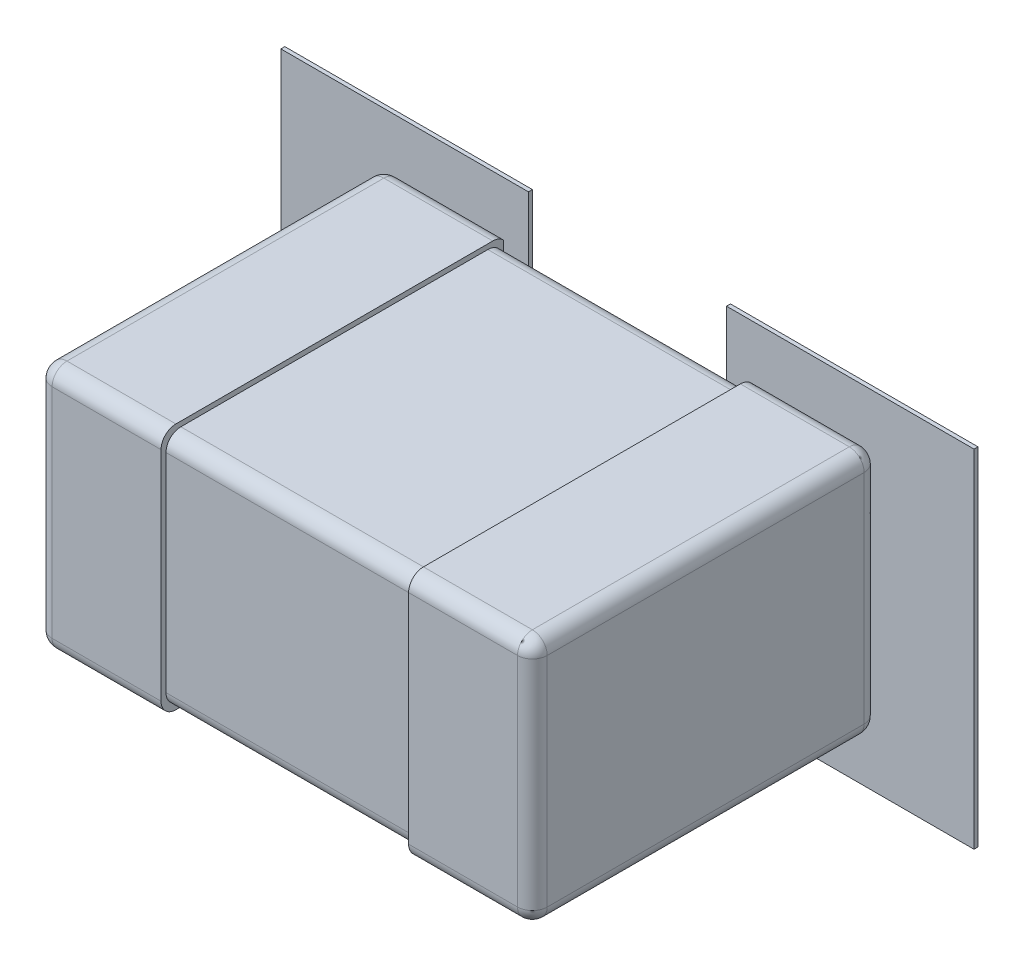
ISO-10303-21;
HEADER;
FILE_DESCRIPTION(('STEP AP214'),'2;1');
FILE_NAME('part.step','',(''),(''),'','','');
FILE_SCHEMA(('AUTOMOTIVE_DESIGN { 1 0 10303 214 1 1 1 1 }'));
ENDSEC;
DATA;
#1=APPLICATION_CONTEXT('core data for automotive mechanical design processes');
#2=APPLICATION_PROTOCOL_DEFINITION('international standard','automotive_design',2000,#1);
#3=PRODUCT_CONTEXT('',#1,'mechanical');
#4=PRODUCT('Part','Part','',(#3));
#5=PRODUCT_RELATED_PRODUCT_CATEGORY('part','',(#4));
#6=PRODUCT_DEFINITION_FORMATION('','',#4);
#7=PRODUCT_DEFINITION_CONTEXT('part definition',#1,'design');
#8=PRODUCT_DEFINITION('design','',#6,#7);
#9=PRODUCT_DEFINITION_SHAPE('','',#8);
#10=(LENGTH_UNIT() NAMED_UNIT(*) SI_UNIT(.MILLI.,.METRE.));
#11=(NAMED_UNIT(*) PLANE_ANGLE_UNIT() SI_UNIT($,.RADIAN.));
#12=(NAMED_UNIT(*) SI_UNIT($,.STERADIAN.) SOLID_ANGLE_UNIT());
#13=UNCERTAINTY_MEASURE_WITH_UNIT(LENGTH_MEASURE(1.E-05),#10,'distance_accuracy_value','');
#14=(GEOMETRIC_REPRESENTATION_CONTEXT(3) GLOBAL_UNCERTAINTY_ASSIGNED_CONTEXT((#13)) GLOBAL_UNIT_ASSIGNED_CONTEXT((#10,
#11,#12)) REPRESENTATION_CONTEXT('',''));
#15=CARTESIAN_POINT('',(0.,0.,0.));
#16=DIRECTION('',(0.,0.,1.));
#17=DIRECTION('',(1.,0.,0.));
#18=AXIS2_PLACEMENT_3D('',#15,#16,#17);
#19=CARTESIAN_POINT('',(0.,0.,0.0762));
#20=DIRECTION('',(0.,0.,1.));
#21=DIRECTION('',(1.,0.,0.));
#22=AXIS2_PLACEMENT_3D('',#19,#20,#21);
#23=PLANE('',#22);
#24=DIRECTION('',(0.,1.,0.));
#25=VECTOR('',#24,1.);
#26=CARTESIAN_POINT('',(0.199999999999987,0.350000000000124,0.0762));
#27=LINE('',#26,#25);
#28=CARTESIAN_POINT('',(0.199999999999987,0.350000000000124,0.0762));
#29=VERTEX_POINT('',#28);
#30=CARTESIAN_POINT('',(0.199999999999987,-0.350000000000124,0.0762));
#31=VERTEX_POINT('',#30);
#32=EDGE_CURVE('E378',#29,#31,#27,.F.);
#33=ORIENTED_EDGE('',*,*,#32,.F.);
#34=DIRECTION('',(1.,0.,0.));
#35=VECTOR('',#34,1.);
#36=CARTESIAN_POINT('',(0.699999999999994,0.350000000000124,0.0762));
#37=LINE('',#36,#35);
#38=CARTESIAN_POINT('',(0.699999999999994,0.350000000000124,0.0762));
#39=VERTEX_POINT('',#38);
#40=EDGE_CURVE('E383',#39,#29,#37,.F.);
#41=ORIENTED_EDGE('',*,*,#40,.F.);
#42=DIRECTION('',(0.,1.,0.));
#43=VECTOR('',#42,1.);
#44=CARTESIAN_POINT('',(0.699999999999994,-0.350000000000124,0.0762));
#45=LINE('',#44,#43);
#46=CARTESIAN_POINT('',(0.699999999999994,-0.350000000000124,0.0762));
#47=VERTEX_POINT('',#46);
#48=EDGE_CURVE('E367',#47,#39,#45,.T.);
#49=ORIENTED_EDGE('',*,*,#48,.F.);
#50=DIRECTION('',(1.,0.,0.));
#51=VECTOR('',#50,1.);
#52=CARTESIAN_POINT('',(0.199999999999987,-0.350000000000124,0.0762));
#53=LINE('',#52,#51);
#54=EDGE_CURVE('E62',#31,#47,#53,.T.);
#55=ORIENTED_EDGE('',*,*,#54,.F.);
#56=EDGE_LOOP('',(#33,#41,#49,#55));
#57=FACE_BOUND('',#56,.T.);
#58=ADVANCED_FACE('F16',(#57),#23,.F.);
#59=CARTESIAN_POINT('',(0.500000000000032,-0.249999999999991,0.0762));
#60=DIRECTION('',(1.,0.,0.));
#61=DIRECTION('',(0.,0.,-1.));
#62=AXIS2_PLACEMENT_3D('',#59,#60,#61);
#63=PLANE('',#62);
#64=DIRECTION('',(0.,0.,-1.));
#65=VECTOR('',#64,1.);
#66=CARTESIAN_POINT('',(0.499999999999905,-0.220000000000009,1.6887752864));
#67=LINE('',#66,#65);
#68=CARTESIAN_POINT('',(0.499999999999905,-0.220000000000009,0.106200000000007));
#69=VERTEX_POINT('',#68);
#70=CARTESIAN_POINT('',(0.499999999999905,-0.220000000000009,0.74622400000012));
#71=VERTEX_POINT('',#70);
#72=EDGE_CURVE('E385',#69,#71,#67,.F.);
#73=ORIENTED_EDGE('',*,*,#72,.F.);
#74=DIRECTION('',(0.,-1.,0.));
#75=VECTOR('',#74,1.);
#76=CARTESIAN_POINT('',(0.499999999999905,1.26251999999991,0.106200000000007));
#77=LINE('',#76,#75);
#78=CARTESIAN_POINT('',(0.499999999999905,0.220000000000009,0.106200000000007));
#79=VERTEX_POINT('',#78);
#80=EDGE_CURVE('E53',#79,#69,#77,.T.);
#81=ORIENTED_EDGE('',*,*,#80,.F.);
#82=DIRECTION('',(0.,0.,-1.));
#83=VECTOR('',#82,1.);
#84=CARTESIAN_POINT('',(0.499999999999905,0.220000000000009,1.6887752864));
#85=LINE('',#84,#83);
#86=CARTESIAN_POINT('',(0.499999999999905,0.220000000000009,0.74622400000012));
#87=VERTEX_POINT('',#86);
#88=EDGE_CURVE('E394',#87,#79,#85,.T.);
#89=ORIENTED_EDGE('',*,*,#88,.F.);
#90=DIRECTION('',(0.,1.,0.));
#91=VECTOR('',#90,1.);
#92=CARTESIAN_POINT('',(0.499999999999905,-1.26251999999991,0.74622400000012));
#93=LINE('',#92,#91);
#94=EDGE_CURVE('E391',#71,#87,#93,.T.);
#95=ORIENTED_EDGE('',*,*,#94,.F.);
#96=EDGE_LOOP('',(#73,#81,#89,#95));
#97=FACE_BOUND('',#96,.T.);
#98=ADVANCED_FACE('F802',(#97),#63,.T.);
#99=CARTESIAN_POINT('',(0.699999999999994,0.350000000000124,0.0762));
#100=DIRECTION('',(0.,1.,0.));
#101=DIRECTION('',(0.,0.,1.));
#102=AXIS2_PLACEMENT_3D('',#99,#100,#101);
#103=PLANE('',#102);
#104=DIRECTION('',(0.,0.,-1.));
#105=VECTOR('',#104,1.);
#106=CARTESIAN_POINT('',(0.699999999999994,0.350000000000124,0.0762));
#107=LINE('',#106,#105);
#108=CARTESIAN_POINT('',(0.699999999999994,0.350000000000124,0.0841999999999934));
#109=VERTEX_POINT('',#108);
#110=EDGE_CURVE('E372',#39,#109,#107,.F.);
#111=ORIENTED_EDGE('',*,*,#110,.F.);
#112=ORIENTED_EDGE('',*,*,#40,.T.);
#113=DIRECTION('',(0.,0.,1.));
#114=VECTOR('',#113,1.);
#115=CARTESIAN_POINT('',(0.199999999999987,0.350000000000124,0.0762));
#116=LINE('',#115,#114);
#117=CARTESIAN_POINT('',(0.199999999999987,0.350000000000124,0.0841999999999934));
#118=VERTEX_POINT('',#117);
#119=EDGE_CURVE('E380',#118,#29,#116,.F.);
#120=ORIENTED_EDGE('',*,*,#119,.F.);
#121=DIRECTION('',(1.,0.,0.));
#122=VECTOR('',#121,1.);
#123=CARTESIAN_POINT('',(0.,0.350000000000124,0.0841999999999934));
#124=LINE('',#123,#122);
#125=EDGE_CURVE('E316',#109,#118,#124,.F.);
#126=ORIENTED_EDGE('',*,*,#125,.F.);
#127=EDGE_LOOP('',(#111,#112,#120,#126));
#128=FACE_BOUND('',#127,.T.);
#129=ADVANCED_FACE('F818',(#128),#103,.T.);
#130=CARTESIAN_POINT('',(0.199999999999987,0.350000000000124,0.0762));
#131=DIRECTION('',(-1.,0.,0.));
#132=DIRECTION('',(0.,0.,1.));
#133=AXIS2_PLACEMENT_3D('',#130,#131,#132);
#134=PLANE('',#133);
#135=ORIENTED_EDGE('',*,*,#119,.T.);
#136=ORIENTED_EDGE('',*,*,#32,.T.);
#137=DIRECTION('',(0.,0.,-1.));
#138=VECTOR('',#137,1.);
#139=CARTESIAN_POINT('',(0.199999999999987,-0.350000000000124,0.0762));
#140=LINE('',#139,#138);
#141=CARTESIAN_POINT('',(0.199999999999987,-0.350000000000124,0.0841999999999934));
#142=VERTEX_POINT('',#141);
#143=EDGE_CURVE('E376',#142,#31,#140,.T.);
#144=ORIENTED_EDGE('',*,*,#143,.F.);
#145=DIRECTION('',(0.,1.,0.));
#146=VECTOR('',#145,1.);
#147=CARTESIAN_POINT('',(0.199999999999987,0.,0.0841999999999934));
#148=LINE('',#147,#146);
#149=EDGE_CURVE('E313',#118,#142,#148,.F.);
#150=ORIENTED_EDGE('',*,*,#149,.F.);
#151=EDGE_LOOP('',(#135,#136,#144,#150));
#152=FACE_BOUND('',#151,.T.);
#153=ADVANCED_FACE('F821',(#152),#134,.T.);
#154=CARTESIAN_POINT('',(0.199999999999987,-0.350000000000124,0.0762));
#155=DIRECTION('',(0.,-1.,0.));
#156=DIRECTION('',(0.,0.,-1.));
#157=AXIS2_PLACEMENT_3D('',#154,#155,#156);
#158=PLANE('',#157);
#159=ORIENTED_EDGE('',*,*,#143,.T.);
#160=ORIENTED_EDGE('',*,*,#54,.T.);
#161=DIRECTION('',(0.,0.,-1.));
#162=VECTOR('',#161,1.);
#163=CARTESIAN_POINT('',(0.699999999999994,-0.350000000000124,0.0762));
#164=LINE('',#163,#162);
#165=CARTESIAN_POINT('',(0.699999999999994,-0.350000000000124,0.0841999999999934));
#166=VERTEX_POINT('',#165);
#167=EDGE_CURVE('E370',#166,#47,#164,.T.);
#168=ORIENTED_EDGE('',*,*,#167,.F.);
#169=DIRECTION('',(1.,0.,0.));
#170=VECTOR('',#169,1.);
#171=CARTESIAN_POINT('',(0.,-0.350000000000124,0.0841999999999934));
#172=LINE('',#171,#170);
#173=EDGE_CURVE('E310',#142,#166,#172,.T.);
#174=ORIENTED_EDGE('',*,*,#173,.F.);
#175=EDGE_LOOP('',(#159,#160,#168,#174));
#176=FACE_BOUND('',#175,.T.);
#177=ADVANCED_FACE('F822',(#176),#158,.T.);
#178=CARTESIAN_POINT('',(0.699999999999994,-0.350000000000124,0.0762));
#179=DIRECTION('',(1.,0.,0.));
#180=DIRECTION('',(0.,0.,-1.));
#181=AXIS2_PLACEMENT_3D('',#178,#179,#180);
#182=PLANE('',#181);
#183=ORIENTED_EDGE('',*,*,#167,.T.);
#184=ORIENTED_EDGE('',*,*,#48,.T.);
#185=ORIENTED_EDGE('',*,*,#110,.T.);
#186=DIRECTION('',(0.,1.,0.));
#187=VECTOR('',#186,1.);
#188=CARTESIAN_POINT('',(0.699999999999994,0.,0.0841999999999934));
#189=LINE('',#188,#187);
#190=EDGE_CURVE('E307',#166,#109,#189,.T.);
#191=ORIENTED_EDGE('',*,*,#190,.F.);
#192=EDGE_LOOP('',(#183,#184,#185,#191));
#193=FACE_BOUND('',#192,.T.);
#194=ADVANCED_FACE('F824',(#193),#182,.T.);
#195=CARTESIAN_POINT('',(0.469999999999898,1.26251999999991,0.106200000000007));
#196=DIRECTION('',(0.,-1.,0.));
#197=DIRECTION('',(0.,0.,-1.));
#198=AXIS2_PLACEMENT_3D('',#195,#196,#197);
#199=CYLINDRICAL_SURFACE('',#198,0.030000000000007);
#200=CARTESIAN_POINT('',(0.469999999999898,-0.220000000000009,0.106200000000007));
#201=DIRECTION('',(0.,-1.,0.));
#202=DIRECTION('',(0.,0.,-1.));
#203=AXIS2_PLACEMENT_3D('',#200,#201,#202);
#204=CIRCLE('',#203,0.030000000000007);
#205=CARTESIAN_POINT('',(0.490396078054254,-0.220000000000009,0.0841999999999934));
#206=VERTEX_POINT('',#205);
#207=EDGE_CURVE('E388',#206,#69,#204,.T.);
#208=ORIENTED_EDGE('',*,*,#207,.F.);
#209=DIRECTION('',(0.,1.,0.));
#210=VECTOR('',#209,1.);
#211=CARTESIAN_POINT('',(0.490396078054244,0.,0.0841999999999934));
#212=LINE('',#211,#210);
#213=CARTESIAN_POINT('',(0.490396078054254,0.220000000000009,0.0841999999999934));
#214=VERTEX_POINT('',#213);
#215=EDGE_CURVE('E303',#214,#206,#212,.F.);
#216=ORIENTED_EDGE('',*,*,#215,.F.);
#217=CARTESIAN_POINT('',(0.469999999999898,0.220000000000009,0.106200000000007));
#218=DIRECTION('',(0.,-1.,0.));
#219=DIRECTION('',(0.,0.,-1.));
#220=AXIS2_PLACEMENT_3D('',#217,#218,#219);
#221=CIRCLE('',#220,0.030000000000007);
#222=EDGE_CURVE('E19',#79,#214,#221,.F.);
#223=ORIENTED_EDGE('',*,*,#222,.F.);
#224=ORIENTED_EDGE('',*,*,#80,.T.);
#225=EDGE_LOOP('',(#208,#216,#223,#224));
#226=FACE_BOUND('',#225,.T.);
#227=ADVANCED_FACE('F359',(#226),#199,.T.);
#228=CARTESIAN_POINT('',(0.469999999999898,0.220000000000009,0.106200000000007));
#229=DIRECTION('',(0.707106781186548,0.707106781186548,0.));
#230=DIRECTION('',(0.,0.,-1.));
#231=AXIS2_PLACEMENT_3D('',#228,#229,#230);
#232=SPHERICAL_SURFACE('',#231,0.030000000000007);
#233=ORIENTED_EDGE('',*,*,#222,.T.);
#234=CARTESIAN_POINT('',(0.469999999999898,0.240396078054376,0.0841999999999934));
#235=CARTESIAN_POINT('',(0.472298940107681,0.240411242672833,0.0841999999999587));
#236=CARTESIAN_POINT('',(0.474588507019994,0.240009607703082,0.0841999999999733));
#237=CARTESIAN_POINT('',(0.478913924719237,0.238483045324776,0.0842000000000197));
#238=CARTESIAN_POINT('',(0.480949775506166,0.237358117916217,0.0842000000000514));
#239=CARTESIAN_POINT('',(0.484532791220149,0.234495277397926,0.0842000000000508));
#240=CARTESIAN_POINT('',(0.486079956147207,0.2327573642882,0.0842000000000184));
#241=CARTESIAN_POINT('',(0.48850977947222,0.228865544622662,0.0842000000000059));
#242=CARTESIAN_POINT('',(0.489392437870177,0.226711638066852,0.0842000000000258));
#243=CARTESIAN_POINT('',(0.490231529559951,0.223007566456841,0.0842000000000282));
#244=CARTESIAN_POINT('',(0.490401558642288,0.221503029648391,0.0842000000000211));
#245=CARTESIAN_POINT('',(0.490396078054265,0.220000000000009,0.0841999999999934));
#246=B_SPLINE_CURVE_WITH_KNOTS('',3,(#234,#235,#236,#237,#238,#239,#240,#241,#242,#243,#244,
#245),.UNSPECIFIED.,.F.,.F.,(4,2,2,2,2,4),(0.,0.00684841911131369,0.0136968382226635,
0.0205452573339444,0.0273936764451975,0.0318985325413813),.UNSPECIFIED.);
#247=CARTESIAN_POINT('',(0.469999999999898,0.240396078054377,0.0841999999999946));
#248=VERTEX_POINT('',#247);
#249=EDGE_CURVE('E306',#248,#214,#246,.T.);
#250=ORIENTED_EDGE('',*,*,#249,.F.);
#251=CARTESIAN_POINT('',(0.469999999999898,0.220000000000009,0.106200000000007));
#252=DIRECTION('',(1.,0.,0.));
#253=DIRECTION('',(0.,0.,-1.));
#254=AXIS2_PLACEMENT_3D('',#251,#252,#253);
#255=CIRCLE('',#254,0.030000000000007);
#256=CARTESIAN_POINT('',(0.469999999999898,0.250000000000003,0.106200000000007));
#257=VERTEX_POINT('',#256);
#258=EDGE_CURVE('E302',#257,#248,#255,.F.);
#259=ORIENTED_EDGE('',*,*,#258,.F.);
#260=CARTESIAN_POINT('',(0.469999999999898,0.220000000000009,0.106200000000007));
#261=DIRECTION('',(0.,0.,-1.));
#262=DIRECTION('',(-1.,0.,0.));
#263=AXIS2_PLACEMENT_3D('',#260,#261,#262);
#264=CIRCLE('',#263,0.030000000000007);
#265=CARTESIAN_POINT('',(0.491213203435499,0.24121320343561,0.106200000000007));
#266=VERTEX_POINT('',#265);
#267=EDGE_CURVE('E269',#266,#257,#264,.F.);
#268=ORIENTED_EDGE('',*,*,#267,.F.);
#269=CARTESIAN_POINT('',(0.469999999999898,0.220000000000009,0.106200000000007));
#270=DIRECTION('',(0.,0.,-1.));
#271=DIRECTION('',(-1.,0.,0.));
#272=AXIS2_PLACEMENT_3D('',#269,#270,#271);
#273=CIRCLE('',#272,0.030000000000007);
#274=EDGE_CURVE('E34',#79,#266,#273,.F.);
#275=ORIENTED_EDGE('',*,*,#274,.F.);
#276=EDGE_LOOP('',(#233,#250,#259,#268,#275));
#277=FACE_BOUND('',#276,.T.);
#278=ADVANCED_FACE('F353',(#277),#232,.T.);
#279=CARTESIAN_POINT('',(0.469999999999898,0.220000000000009,1.6887752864));
#280=DIRECTION('',(0.,0.,-1.));
#281=DIRECTION('',(-1.,0.,0.));
#282=AXIS2_PLACEMENT_3D('',#279,#280,#281);
#283=CYLINDRICAL_SURFACE('',#282,0.030000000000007);
#284=ORIENTED_EDGE('',*,*,#267,.T.);
#285=DIRECTION('',(0.,0.,1.));
#286=VECTOR('',#285,1.);
#287=CARTESIAN_POINT('',(0.469999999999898,0.249999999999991,0.0762));
#288=LINE('',#287,#286);
#289=CARTESIAN_POINT('',(0.469999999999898,0.250000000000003,0.74622400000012));
#290=VERTEX_POINT('',#289);
#291=EDGE_CURVE('E281',#290,#257,#288,.F.);
#292=ORIENTED_EDGE('',*,*,#291,.F.);
#293=CARTESIAN_POINT('',(0.469999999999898,0.220000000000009,0.74622400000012));
#294=DIRECTION('',(0.,0.,-1.));
#295=DIRECTION('',(-1.,0.,0.));
#296=AXIS2_PLACEMENT_3D('',#293,#294,#295);
#297=CIRCLE('',#296,0.030000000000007);
#298=EDGE_CURVE('E264',#87,#290,#297,.F.);
#299=ORIENTED_EDGE('',*,*,#298,.F.);
#300=ORIENTED_EDGE('',*,*,#88,.T.);
#301=ORIENTED_EDGE('',*,*,#274,.T.);
#302=EDGE_LOOP('',(#284,#292,#299,#300,#301));
#303=FACE_BOUND('',#302,.T.);
#304=ADVANCED_FACE('F282',(#303),#283,.T.);
#305=CARTESIAN_POINT('',(0.469999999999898,0.220000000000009,0.74622400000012));
#306=DIRECTION('',(0.,0.707106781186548,0.707106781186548));
#307=DIRECTION('',(1.,0.,0.));
#308=AXIS2_PLACEMENT_3D('',#305,#306,#307);
#309=SPHERICAL_SURFACE('',#308,0.030000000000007);
#310=CARTESIAN_POINT('',(0.469999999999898,0.220000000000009,0.74622400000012));
#311=DIRECTION('',(0.,1.,0.));
#312=DIRECTION('',(0.,0.,1.));
#313=AXIS2_PLACEMENT_3D('',#310,#311,#312);
#314=CIRCLE('',#313,0.030000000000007);
#315=CARTESIAN_POINT('',(0.469999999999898,0.220000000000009,0.776224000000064));
#316=VERTEX_POINT('',#315);
#317=EDGE_CURVE('E258',#87,#316,#314,.F.);
#318=ORIENTED_EDGE('',*,*,#317,.F.);
#319=ORIENTED_EDGE('',*,*,#298,.T.);
#320=CARTESIAN_POINT('',(0.469999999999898,0.220000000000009,0.74622400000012));
#321=DIRECTION('',(-1.,0.,0.));
#322=DIRECTION('',(0.,0.,1.));
#323=AXIS2_PLACEMENT_3D('',#320,#321,#322);
#324=CIRCLE('',#323,0.030000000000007);
#325=CARTESIAN_POINT('',(0.469999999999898,0.24121320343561,0.767437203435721));
#326=VERTEX_POINT('',#325);
#327=EDGE_CURVE('E267',#326,#290,#324,.T.);
#328=ORIENTED_EDGE('',*,*,#327,.F.);
#329=CARTESIAN_POINT('',(0.469999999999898,0.220000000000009,0.74622400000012));
#330=DIRECTION('',(-1.,0.,0.));
#331=DIRECTION('',(0.,0.,1.));
#332=AXIS2_PLACEMENT_3D('',#329,#330,#331);
#333=CIRCLE('',#332,0.030000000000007);
#334=EDGE_CURVE('E278',#316,#326,#333,.T.);
#335=ORIENTED_EDGE('',*,*,#334,.F.);
#336=EDGE_LOOP('',(#318,#319,#328,#335));
#337=FACE_BOUND('',#336,.T.);
#338=ADVANCED_FACE('F266',(#337),#309,.T.);
#339=CARTESIAN_POINT('',(0.469999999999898,-1.26251999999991,0.74622400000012));
#340=DIRECTION('',(0.,1.,0.));
#341=DIRECTION('',(0.,0.,1.));
#342=AXIS2_PLACEMENT_3D('',#339,#340,#341);
#343=CYLINDRICAL_SURFACE('',#342,0.030000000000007);
#344=CARTESIAN_POINT('',(0.469999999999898,-0.220000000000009,0.74622400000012));
#345=DIRECTION('',(0.,1.,0.));
#346=DIRECTION('',(0.,0.,1.));
#347=AXIS2_PLACEMENT_3D('',#344,#345,#346);
#348=CIRCLE('',#347,0.030000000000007);
#349=CARTESIAN_POINT('',(0.491213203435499,-0.220000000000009,0.767437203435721));
#350=VERTEX_POINT('',#349);
#351=EDGE_CURVE('E393',#71,#350,#348,.F.);
#352=ORIENTED_EDGE('',*,*,#351,.F.);
#353=ORIENTED_EDGE('',*,*,#94,.T.);
#354=ORIENTED_EDGE('',*,*,#317,.T.);
#355=DIRECTION('',(0.,1.,0.));
#356=VECTOR('',#355,1.);
#357=CARTESIAN_POINT('',(0.469999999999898,0.,0.776224));
#358=LINE('',#357,#356);
#359=CARTESIAN_POINT('',(0.469999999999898,-0.220000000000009,0.776224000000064));
#360=VERTEX_POINT('',#359);
#361=EDGE_CURVE('E292',#360,#316,#358,.T.);
#362=ORIENTED_EDGE('',*,*,#361,.F.);
#363=CARTESIAN_POINT('',(0.469999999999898,-0.220000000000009,0.74622400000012));
#364=DIRECTION('',(0.,-1.,0.));
#365=DIRECTION('',(0.707106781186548,0.,0.707106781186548));
#366=AXIS2_PLACEMENT_3D('',#363,#364,#365);
#367=CIRCLE('',#366,0.030000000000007);
#368=EDGE_CURVE('E777',#350,#360,#367,.T.);
#369=ORIENTED_EDGE('',*,*,#368,.F.);
#370=EDGE_LOOP('',(#352,#353,#354,#362,#369));
#371=FACE_BOUND('',#370,.T.);
#372=ADVANCED_FACE('F788',(#371),#343,.T.);
#373=CARTESIAN_POINT('',(0.469999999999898,-0.220000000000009,0.74622400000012));
#374=DIRECTION('',(0.707106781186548,0.,0.707106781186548));
#375=DIRECTION('',(0.,-1.,0.));
#376=AXIS2_PLACEMENT_3D('',#373,#374,#375);
#377=SPHERICAL_SURFACE('',#376,0.030000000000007);
#378=ORIENTED_EDGE('',*,*,#351,.T.);
#379=ORIENTED_EDGE('',*,*,#368,.T.);
#380=CARTESIAN_POINT('',(0.469999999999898,-0.220000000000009,0.74622400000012));
#381=DIRECTION('',(1.,0.,0.));
#382=DIRECTION('',(0.,0.,-1.));
#383=AXIS2_PLACEMENT_3D('',#380,#381,#382);
#384=CIRCLE('',#383,0.030000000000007);
#385=CARTESIAN_POINT('',(0.469999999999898,-0.250000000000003,0.74622400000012));
#386=VERTEX_POINT('',#385);
#387=EDGE_CURVE('E760',#386,#360,#384,.F.);
#388=ORIENTED_EDGE('',*,*,#387,.F.);
#389=CARTESIAN_POINT('',(0.469999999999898,-0.220000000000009,0.74622400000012));
#390=DIRECTION('',(0.,0.,-1.));
#391=DIRECTION('',(-1.,0.,0.));
#392=AXIS2_PLACEMENT_3D('',#389,#390,#391);
#393=CIRCLE('',#392,0.030000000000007);
#394=EDGE_CURVE('E389',#71,#386,#393,.T.);
#395=ORIENTED_EDGE('',*,*,#394,.F.);
#396=EDGE_LOOP('',(#378,#379,#388,#395));
#397=FACE_BOUND('',#396,.T.);
#398=ADVANCED_FACE('F775',(#397),#377,.T.);
#399=CARTESIAN_POINT('',(0.469999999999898,-0.220000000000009,1.6887752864));
#400=DIRECTION('',(0.,0.,-1.));
#401=DIRECTION('',(-1.,0.,0.));
#402=AXIS2_PLACEMENT_3D('',#399,#400,#401);
#403=CYLINDRICAL_SURFACE('',#402,0.030000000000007);
#404=CARTESIAN_POINT('',(0.469999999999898,-0.220000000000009,0.106200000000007));
#405=DIRECTION('',(0.,0.,-1.));
#406=DIRECTION('',(-1.,0.,0.));
#407=AXIS2_PLACEMENT_3D('',#404,#405,#406);
#408=CIRCLE('',#407,0.030000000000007);
#409=CARTESIAN_POINT('',(0.491213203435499,-0.24121320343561,0.106200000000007));
#410=VERTEX_POINT('',#409);
#411=EDGE_CURVE('E351',#69,#410,#408,.T.);
#412=ORIENTED_EDGE('',*,*,#411,.F.);
#413=ORIENTED_EDGE('',*,*,#72,.T.);
#414=ORIENTED_EDGE('',*,*,#394,.T.);
#415=DIRECTION('',(0.,0.,-1.));
#416=VECTOR('',#415,1.);
#417=CARTESIAN_POINT('',(0.469999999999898,-0.249999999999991,0.0762));
#418=LINE('',#417,#416);
#419=CARTESIAN_POINT('',(0.469999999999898,-0.250000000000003,0.106200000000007));
#420=VERTEX_POINT('',#419);
#421=EDGE_CURVE('E320',#420,#386,#418,.F.);
#422=ORIENTED_EDGE('',*,*,#421,.F.);
#423=CARTESIAN_POINT('',(0.469999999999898,-0.220000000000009,0.106200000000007));
#424=DIRECTION('',(0.,0.,-1.));
#425=DIRECTION('',(0.707106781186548,-0.707106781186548,0.));
#426=AXIS2_PLACEMENT_3D('',#423,#424,#425);
#427=CIRCLE('',#426,0.030000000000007);
#428=EDGE_CURVE('E319',#410,#420,#427,.T.);
#429=ORIENTED_EDGE('',*,*,#428,.F.);
#430=EDGE_LOOP('',(#412,#413,#414,#422,#429));
#431=FACE_BOUND('',#430,.T.);
#432=ADVANCED_FACE('F334',(#431),#403,.T.);
#433=CARTESIAN_POINT('',(0.469999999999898,-0.220000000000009,0.106200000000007));
#434=DIRECTION('',(0.707106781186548,-0.707106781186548,0.));
#435=DIRECTION('',(0.,0.,-1.));
#436=AXIS2_PLACEMENT_3D('',#433,#434,#435);
#437=SPHERICAL_SURFACE('',#436,0.030000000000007);
#438=CARTESIAN_POINT('',(0.469999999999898,-0.220000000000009,0.106200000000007));
#439=DIRECTION('',(-1.,0.,0.));
#440=DIRECTION('',(0.,0.,1.));
#441=AXIS2_PLACEMENT_3D('',#438,#439,#440);
#442=CIRCLE('',#441,0.030000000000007);
#443=CARTESIAN_POINT('',(0.469999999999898,-0.240396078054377,0.0841999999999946));
#444=VERTEX_POINT('',#443);
#445=EDGE_CURVE('E756',#444,#420,#442,.T.);
#446=ORIENTED_EDGE('',*,*,#445,.F.);
#447=CARTESIAN_POINT('',(0.490396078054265,-0.220000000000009,0.0841999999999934));
#448=CARTESIAN_POINT('',(0.490411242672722,-0.222298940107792,0.0841999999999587));
#449=CARTESIAN_POINT('',(0.490009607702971,-0.224588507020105,0.0841999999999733));
#450=CARTESIAN_POINT('',(0.488483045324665,-0.228913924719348,0.0842000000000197));
#451=CARTESIAN_POINT('',(0.487358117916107,-0.230949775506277,0.0842000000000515));
#452=CARTESIAN_POINT('',(0.484495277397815,-0.234532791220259,0.0842000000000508));
#453=CARTESIAN_POINT('',(0.482757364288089,-0.236079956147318,0.0842000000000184));
#454=CARTESIAN_POINT('',(0.478865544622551,-0.238509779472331,0.0842000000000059));
#455=CARTESIAN_POINT('',(0.476711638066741,-0.239392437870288,0.0842000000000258));
#456=CARTESIAN_POINT('',(0.47300756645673,-0.240231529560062,0.0842000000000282));
#457=CARTESIAN_POINT('',(0.47150302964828,-0.240401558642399,0.0842000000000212));
#458=CARTESIAN_POINT('',(0.469999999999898,-0.240396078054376,0.0841999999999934));
#459=B_SPLINE_CURVE_WITH_KNOTS('',3,(#447,#448,#449,#450,#451,#452,#453,#454,#455,#456,#457,
#458),.UNSPECIFIED.,.F.,.F.,(4,2,2,2,2,4),(0.,0.00684841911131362,0.0136968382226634,
0.0205452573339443,0.0273936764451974,0.0318985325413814),.UNSPECIFIED.);
#460=EDGE_CURVE('E305',#206,#444,#459,.T.);
#461=ORIENTED_EDGE('',*,*,#460,.F.);
#462=ORIENTED_EDGE('',*,*,#207,.T.);
#463=ORIENTED_EDGE('',*,*,#411,.T.);
#464=ORIENTED_EDGE('',*,*,#428,.T.);
#465=EDGE_LOOP('',(#446,#461,#462,#463,#464));
#466=FACE_BOUND('',#465,.T.);
#467=ADVANCED_FACE('F328',(#466),#437,.T.);
#468=CARTESIAN_POINT('',(0.,0.,0.0841999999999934));
#469=DIRECTION('',(0.,0.,1.));
#470=DIRECTION('',(1.,0.,0.));
#471=AXIS2_PLACEMENT_3D('',#468,#469,#470);
#472=PLANE('',#471);
#473=DIRECTION('',(-1.,0.,0.));
#474=VECTOR('',#473,1.);
#475=CARTESIAN_POINT('',(2.52504000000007,-0.240396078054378,0.0841999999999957));
#476=LINE('',#475,#474);
#477=CARTESIAN_POINT('',(0.249999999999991,-0.240396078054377,0.0841999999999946));
#478=VERTEX_POINT('',#477);
#479=EDGE_CURVE('E686',#478,#444,#476,.F.);
#480=ORIENTED_EDGE('',*,*,#479,.F.);
#481=DIRECTION('',(0.,1.,0.));
#482=VECTOR('',#481,1.);
#483=CARTESIAN_POINT('',(0.249999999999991,-0.249999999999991,0.0841999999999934));
#484=LINE('',#483,#482);
#485=CARTESIAN_POINT('',(0.249999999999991,0.240396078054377,0.0841999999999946));
#486=VERTEX_POINT('',#485);
#487=EDGE_CURVE('E684',#478,#486,#484,.T.);
#488=ORIENTED_EDGE('',*,*,#487,.T.);
#489=DIRECTION('',(1.,0.,0.));
#490=VECTOR('',#489,1.);
#491=CARTESIAN_POINT('',(-2.52504000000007,0.240396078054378,0.0841999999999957));
#492=LINE('',#491,#490);
#493=EDGE_CURVE('E286',#248,#486,#492,.F.);
#494=ORIENTED_EDGE('',*,*,#493,.F.);
#495=ORIENTED_EDGE('',*,*,#249,.T.);
#496=ORIENTED_EDGE('',*,*,#215,.T.);
#497=ORIENTED_EDGE('',*,*,#460,.T.);
#498=EDGE_LOOP('',(#480,#488,#494,#495,#496,#497));
#499=FACE_BOUND('',#498,.T.);
#500=ORIENTED_EDGE('',*,*,#173,.T.);
#501=ORIENTED_EDGE('',*,*,#190,.T.);
#502=ORIENTED_EDGE('',*,*,#125,.T.);
#503=ORIENTED_EDGE('',*,*,#149,.T.);
#504=EDGE_LOOP('',(#500,#501,#502,#503));
#505=FACE_BOUND('',#504,.T.);
#506=ADVANCED_FACE('F333',(#499,#505),#472,.T.);
#507=CARTESIAN_POINT('',(-2.52504000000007,0.220000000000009,0.106200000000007));
#508=DIRECTION('',(1.,0.,0.));
#509=DIRECTION('',(0.,0.,-1.));
#510=AXIS2_PLACEMENT_3D('',#507,#508,#509);
#511=CYLINDRICAL_SURFACE('',#510,0.030000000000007);
#512=ORIENTED_EDGE('',*,*,#258,.T.);
#513=ORIENTED_EDGE('',*,*,#493,.T.);
#514=CARTESIAN_POINT('',(0.249999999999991,0.220000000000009,0.106200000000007));
#515=DIRECTION('',(1.,0.,0.));
#516=DIRECTION('',(0.,0.,-1.));
#517=AXIS2_PLACEMENT_3D('',#514,#515,#516);
#518=CIRCLE('',#517,0.030000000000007);
#519=CARTESIAN_POINT('',(0.249999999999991,0.249999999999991,0.106200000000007));
#520=VERTEX_POINT('',#519);
#521=EDGE_CURVE('E690',#486,#520,#518,.T.);
#522=ORIENTED_EDGE('',*,*,#521,.T.);
#523=DIRECTION('',(1.,0.,0.));
#524=VECTOR('',#523,1.);
#525=CARTESIAN_POINT('',(0.500000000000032,0.249999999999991,0.106200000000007));
#526=LINE('',#525,#524);
#527=EDGE_CURVE('E285',#257,#520,#526,.F.);
#528=ORIENTED_EDGE('',*,*,#527,.F.);
#529=EDGE_LOOP('',(#512,#513,#522,#528));
#530=FACE_BOUND('',#529,.T.);
#531=ADVANCED_FACE('F666',(#530),#511,.T.);
#532=CARTESIAN_POINT('',(0.500000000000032,0.249999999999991,0.0762));
#533=DIRECTION('',(0.,1.,0.));
#534=DIRECTION('',(0.,0.,1.));
#535=AXIS2_PLACEMENT_3D('',#532,#533,#534);
#536=PLANE('',#535);
#537=DIRECTION('',(0.,0.,-1.));
#538=VECTOR('',#537,1.);
#539=CARTESIAN_POINT('',(0.249999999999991,0.249999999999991,0.0862000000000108));
#540=LINE('',#539,#538);
#541=CARTESIAN_POINT('',(0.249999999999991,0.250000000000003,0.74622400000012));
#542=VERTEX_POINT('',#541);
#543=EDGE_CURVE('E291',#520,#542,#540,.F.);
#544=ORIENTED_EDGE('',*,*,#543,.T.);
#545=DIRECTION('',(-1.,0.,0.));
#546=VECTOR('',#545,1.);
#547=CARTESIAN_POINT('',(2.52504000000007,0.250000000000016,0.74622400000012));
#548=LINE('',#547,#546);
#549=EDGE_CURVE('E275',#290,#542,#548,.T.);
#550=ORIENTED_EDGE('',*,*,#549,.F.);
#551=ORIENTED_EDGE('',*,*,#291,.T.);
#552=ORIENTED_EDGE('',*,*,#527,.T.);
#553=EDGE_LOOP('',(#544,#550,#551,#552));
#554=FACE_BOUND('',#553,.T.);
#555=ADVANCED_FACE('F289',(#554),#536,.T.);
#556=CARTESIAN_POINT('',(2.52504000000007,0.220000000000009,0.74622400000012));
#557=DIRECTION('',(-1.,0.,0.));
#558=DIRECTION('',(0.,0.,1.));
#559=AXIS2_PLACEMENT_3D('',#556,#557,#558);
#560=CYLINDRICAL_SURFACE('',#559,0.030000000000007);
#561=ORIENTED_EDGE('',*,*,#549,.T.);
#562=CARTESIAN_POINT('',(0.249999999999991,0.220000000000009,0.74622400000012));
#563=DIRECTION('',(-1.,0.,0.));
#564=DIRECTION('',(0.,0.,1.));
#565=AXIS2_PLACEMENT_3D('',#562,#563,#564);
#566=CIRCLE('',#565,0.030000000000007);
#567=CARTESIAN_POINT('',(0.249999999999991,0.220000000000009,0.776224));
#568=VERTEX_POINT('',#567);
#569=EDGE_CURVE('E747',#542,#568,#566,.F.);
#570=ORIENTED_EDGE('',*,*,#569,.T.);
#571=DIRECTION('',(1.,0.,0.));
#572=VECTOR('',#571,1.);
#573=CARTESIAN_POINT('',(0.,0.220000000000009,0.776224));
#574=LINE('',#573,#572);
#575=EDGE_CURVE('E295',#316,#568,#574,.F.);
#576=ORIENTED_EDGE('',*,*,#575,.F.);
#577=ORIENTED_EDGE('',*,*,#334,.T.);
#578=ORIENTED_EDGE('',*,*,#327,.T.);
#579=EDGE_LOOP('',(#561,#570,#576,#577,#578));
#580=FACE_BOUND('',#579,.T.);
#581=ADVANCED_FACE('F272',(#580),#560,.T.);
#582=CARTESIAN_POINT('',(0.,0.,0.776224));
#583=DIRECTION('',(0.,0.,1.));
#584=DIRECTION('',(1.,0.,0.));
#585=AXIS2_PLACEMENT_3D('',#582,#583,#584);
#586=PLANE('',#585);
#587=DIRECTION('',(0.,1.,0.));
#588=VECTOR('',#587,1.);
#589=CARTESIAN_POINT('',(0.249999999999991,-0.249999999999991,0.776224));
#590=LINE('',#589,#588);
#591=CARTESIAN_POINT('',(0.249999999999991,-0.220000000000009,0.776224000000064));
#592=VERTEX_POINT('',#591);
#593=EDGE_CURVE('E745',#568,#592,#590,.F.);
#594=ORIENTED_EDGE('',*,*,#593,.T.);
#595=DIRECTION('',(1.,0.,0.));
#596=VECTOR('',#595,1.);
#597=CARTESIAN_POINT('',(-2.52504000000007,-0.220000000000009,0.776224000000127));
#598=LINE('',#597,#596);
#599=EDGE_CURVE('E324',#360,#592,#598,.F.);
#600=ORIENTED_EDGE('',*,*,#599,.F.);
#601=ORIENTED_EDGE('',*,*,#361,.T.);
#602=ORIENTED_EDGE('',*,*,#575,.T.);
#603=EDGE_LOOP('',(#594,#600,#601,#602));
#604=FACE_BOUND('',#603,.T.);
#605=ADVANCED_FACE('F658',(#604),#586,.T.);
#606=CARTESIAN_POINT('',(-2.52504000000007,-0.220000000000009,0.74622400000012));
#607=DIRECTION('',(1.,0.,0.));
#608=DIRECTION('',(0.,0.,-1.));
#609=AXIS2_PLACEMENT_3D('',#606,#607,#608);
#610=CYLINDRICAL_SURFACE('',#609,0.030000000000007);
#611=ORIENTED_EDGE('',*,*,#599,.T.);
#612=CARTESIAN_POINT('',(0.249999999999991,-0.220000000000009,0.74622400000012));
#613=DIRECTION('',(1.,0.,0.));
#614=DIRECTION('',(0.,0.,-1.));
#615=AXIS2_PLACEMENT_3D('',#612,#613,#614);
#616=CIRCLE('',#615,0.030000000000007);
#617=CARTESIAN_POINT('',(0.249999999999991,-0.249999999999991,0.74622400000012));
#618=VERTEX_POINT('',#617);
#619=EDGE_CURVE('E744',#592,#618,#616,.T.);
#620=ORIENTED_EDGE('',*,*,#619,.T.);
#621=DIRECTION('',(1.,0.,0.));
#622=VECTOR('',#621,1.);
#623=CARTESIAN_POINT('',(-0.500000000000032,-0.249999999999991,0.74622400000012));
#624=LINE('',#623,#622);
#625=EDGE_CURVE('E323',#386,#618,#624,.F.);
#626=ORIENTED_EDGE('',*,*,#625,.F.);
#627=ORIENTED_EDGE('',*,*,#387,.T.);
#628=EDGE_LOOP('',(#611,#620,#626,#627));
#629=FACE_BOUND('',#628,.T.);
#630=ADVANCED_FACE('F654',(#629),#610,.T.);
#631=CARTESIAN_POINT('',(-0.500000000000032,-0.249999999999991,0.0762));
#632=DIRECTION('',(0.,-1.,0.));
#633=DIRECTION('',(0.,0.,-1.));
#634=AXIS2_PLACEMENT_3D('',#631,#632,#633);
#635=PLANE('',#634);
#636=ORIENTED_EDGE('',*,*,#421,.T.);
#637=ORIENTED_EDGE('',*,*,#625,.T.);
#638=DIRECTION('',(0.,0.,-1.));
#639=VECTOR('',#638,1.);
#640=CARTESIAN_POINT('',(0.249999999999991,-0.249999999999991,0.0862000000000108));
#641=LINE('',#640,#639);
#642=CARTESIAN_POINT('',(0.249999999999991,-0.250000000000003,0.106200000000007));
#643=VERTEX_POINT('',#642);
#644=EDGE_CURVE('E742',#618,#643,#641,.T.);
#645=ORIENTED_EDGE('',*,*,#644,.T.);
#646=DIRECTION('',(-1.,0.,0.));
#647=VECTOR('',#646,1.);
#648=CARTESIAN_POINT('',(2.52504000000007,-0.250000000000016,0.106200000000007));
#649=LINE('',#648,#647);
#650=EDGE_CURVE('E759',#420,#643,#649,.T.);
#651=ORIENTED_EDGE('',*,*,#650,.F.);
#652=EDGE_LOOP('',(#636,#637,#645,#651));
#653=FACE_BOUND('',#652,.T.);
#654=ADVANCED_FACE('F650',(#653),#635,.T.);
#655=CARTESIAN_POINT('',(2.52504000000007,-0.220000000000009,0.106200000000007));
#656=DIRECTION('',(-1.,0.,0.));
#657=DIRECTION('',(0.,0.,1.));
#658=AXIS2_PLACEMENT_3D('',#655,#656,#657);
#659=CYLINDRICAL_SURFACE('',#658,0.030000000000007);
#660=CARTESIAN_POINT('',(0.249999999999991,-0.220000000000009,0.106200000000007));
#661=DIRECTION('',(-1.,0.,0.));
#662=DIRECTION('',(0.,0.,1.));
#663=AXIS2_PLACEMENT_3D('',#660,#661,#662);
#664=CIRCLE('',#663,0.030000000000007);
#665=EDGE_CURVE('E730',#643,#478,#664,.F.);
#666=ORIENTED_EDGE('',*,*,#665,.T.);
#667=ORIENTED_EDGE('',*,*,#479,.T.);
#668=ORIENTED_EDGE('',*,*,#445,.T.);
#669=ORIENTED_EDGE('',*,*,#650,.T.);
#670=EDGE_LOOP('',(#666,#667,#668,#669));
#671=FACE_BOUND('',#670,.T.);
#672=ADVANCED_FACE('F646',(#671),#659,.T.);
#673=CARTESIAN_POINT('',(-0.469999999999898,-0.220000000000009,0.74622400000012));
#674=DIRECTION('',(0.,-0.707106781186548,0.707106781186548));
#675=DIRECTION('',(-1.,0.,0.));
#676=AXIS2_PLACEMENT_3D('',#673,#674,#675);
#677=SPHERICAL_SURFACE('',#676,0.030000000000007);
#678=CARTESIAN_POINT('',(-0.469999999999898,-0.220000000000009,0.74622400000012));
#679=DIRECTION('',(0.,-1.,0.));
#680=DIRECTION('',(0.,0.,-1.));
#681=AXIS2_PLACEMENT_3D('',#678,#679,#680);
#682=CIRCLE('',#681,0.030000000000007);
#683=CARTESIAN_POINT('',(-0.499999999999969,-0.220000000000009,0.74622400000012));
#684=VERTEX_POINT('',#683);
#685=CARTESIAN_POINT('',(-0.469999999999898,-0.220000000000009,0.776224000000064));
#686=VERTEX_POINT('',#685);
#687=EDGE_CURVE('E694',#684,#686,#682,.F.);
#688=ORIENTED_EDGE('',*,*,#687,.F.);
#689=CARTESIAN_POINT('',(-0.469999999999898,-0.220000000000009,0.74622400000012));
#690=DIRECTION('',(0.,0.,-1.));
#691=DIRECTION('',(-1.,0.,0.));
#692=AXIS2_PLACEMENT_3D('',#689,#690,#691);
#693=CIRCLE('',#692,0.030000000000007);
#694=CARTESIAN_POINT('',(-0.469999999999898,-0.250000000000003,0.74622400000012));
#695=VERTEX_POINT('',#694);
#696=EDGE_CURVE('E725',#695,#684,#693,.T.);
#697=ORIENTED_EDGE('',*,*,#696,.F.);
#698=CARTESIAN_POINT('',(-0.469999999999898,-0.220000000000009,0.74622400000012));
#699=DIRECTION('',(1.,0.,0.));
#700=DIRECTION('',(0.,0.,-1.));
#701=AXIS2_PLACEMENT_3D('',#698,#699,#700);
#702=CIRCLE('',#701,0.030000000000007);
#703=CARTESIAN_POINT('',(-0.469999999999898,-0.24121320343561,0.767437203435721));
#704=VERTEX_POINT('',#703);
#705=EDGE_CURVE('E637',#704,#695,#702,.T.);
#706=ORIENTED_EDGE('',*,*,#705,.F.);
#707=CARTESIAN_POINT('',(-0.469999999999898,-0.220000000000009,0.74622400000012));
#708=DIRECTION('',(1.,0.,0.));
#709=DIRECTION('',(0.,0.,-1.));
#710=AXIS2_PLACEMENT_3D('',#707,#708,#709);
#711=CIRCLE('',#710,0.030000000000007);
#712=EDGE_CURVE('E635',#686,#704,#711,.T.);
#713=ORIENTED_EDGE('',*,*,#712,.F.);
#714=EDGE_LOOP('',(#688,#697,#706,#713));
#715=FACE_BOUND('',#714,.T.);
#716=ADVANCED_FACE('F643',(#715),#677,.T.);
#717=CARTESIAN_POINT('',(-0.469999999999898,1.26251999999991,0.74622400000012));
#718=DIRECTION('',(0.,-1.,0.));
#719=DIRECTION('',(0.,0.,-1.));
#720=AXIS2_PLACEMENT_3D('',#717,#718,#719);
#721=CYLINDRICAL_SURFACE('',#720,0.030000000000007);
#722=CARTESIAN_POINT('',(-0.469999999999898,0.220000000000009,0.74622400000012));
#723=DIRECTION('',(0.,-1.,0.));
#724=DIRECTION('',(0.,0.,-1.));
#725=AXIS2_PLACEMENT_3D('',#722,#723,#724);
#726=CIRCLE('',#725,0.030000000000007);
#727=CARTESIAN_POINT('',(-0.499999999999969,0.220000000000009,0.74622400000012));
#728=VERTEX_POINT('',#727);
#729=CARTESIAN_POINT('',(-0.469999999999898,0.220000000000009,0.776224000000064));
#730=VERTEX_POINT('',#729);
#731=EDGE_CURVE('E691',#728,#730,#726,.F.);
#732=ORIENTED_EDGE('',*,*,#731,.F.);
#733=DIRECTION('',(0.,1.,0.));
#734=VECTOR('',#733,1.);
#735=CARTESIAN_POINT('',(-0.500000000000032,0.249999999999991,0.74622400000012));
#736=LINE('',#735,#734);
#737=EDGE_CURVE('E641',#684,#728,#736,.T.);
#738=ORIENTED_EDGE('',*,*,#737,.F.);
#739=ORIENTED_EDGE('',*,*,#687,.T.);
#740=DIRECTION('',(0.,1.,0.));
#741=VECTOR('',#740,1.);
#742=CARTESIAN_POINT('',(-0.469999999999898,0.,0.776224));
#743=LINE('',#742,#741);
#744=EDGE_CURVE('E633',#730,#686,#743,.F.);
#745=ORIENTED_EDGE('',*,*,#744,.F.);
#746=EDGE_LOOP('',(#732,#738,#739,#745));
#747=FACE_BOUND('',#746,.T.);
#748=ADVANCED_FACE('F627',(#747),#721,.T.);
#749=CARTESIAN_POINT('',(-0.469999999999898,0.220000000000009,0.74622400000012));
#750=DIRECTION('',(-0.707106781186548,0.707106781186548,0.));
#751=DIRECTION('',(0.,0.,1.));
#752=AXIS2_PLACEMENT_3D('',#749,#750,#751);
#753=SPHERICAL_SURFACE('',#752,0.030000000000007);
#754=ORIENTED_EDGE('',*,*,#731,.T.);
#755=CARTESIAN_POINT('',(-0.469999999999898,0.220000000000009,0.74622400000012));
#756=DIRECTION('',(-1.,0.,0.));
#757=DIRECTION('',(0.,0.,1.));
#758=AXIS2_PLACEMENT_3D('',#755,#756,#757);
#759=CIRCLE('',#758,0.030000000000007);
#760=CARTESIAN_POINT('',(-0.469999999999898,0.250000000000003,0.74622400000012));
#761=VERTEX_POINT('',#760);
#762=EDGE_CURVE('E1205',#761,#730,#759,.F.);
#763=ORIENTED_EDGE('',*,*,#762,.F.);
#764=CARTESIAN_POINT('',(-0.469999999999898,0.220000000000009,0.74622400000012));
#765=DIRECTION('',(0.,0.,-1.));
#766=DIRECTION('',(-1.,0.,0.));
#767=AXIS2_PLACEMENT_3D('',#764,#765,#766);
#768=CIRCLE('',#767,0.030000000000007);
#769=CARTESIAN_POINT('',(-0.491213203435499,0.24121320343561,0.74622400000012));
#770=VERTEX_POINT('',#769);
#771=EDGE_CURVE('E714',#770,#761,#768,.T.);
#772=ORIENTED_EDGE('',*,*,#771,.F.);
#773=CARTESIAN_POINT('',(-0.469999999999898,0.220000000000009,0.74622400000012));
#774=DIRECTION('',(0.,0.,-1.));
#775=DIRECTION('',(-1.,0.,0.));
#776=AXIS2_PLACEMENT_3D('',#773,#774,#775);
#777=CIRCLE('',#776,0.030000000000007);
#778=EDGE_CURVE('E713',#728,#770,#777,.T.);
#779=ORIENTED_EDGE('',*,*,#778,.F.);
#780=EDGE_LOOP('',(#754,#763,#772,#779));
#781=FACE_BOUND('',#780,.T.);
#782=ADVANCED_FACE('F622',(#781),#753,.T.);
#783=CARTESIAN_POINT('',(0.249999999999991,-0.249999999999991,0.0862000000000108));
#784=DIRECTION('',(1.,0.,0.));
#785=DIRECTION('',(0.,0.,-1.));
#786=AXIS2_PLACEMENT_3D('',#783,#784,#785);
#787=PLANE('',#786);
#788=DIRECTION('',(0.,0.,1.));
#789=VECTOR('',#788,1.);
#790=CARTESIAN_POINT('',(0.249999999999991,-0.240000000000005,0.776224));
#791=LINE('',#790,#789);
#792=CARTESIAN_POINT('',(0.249999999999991,-0.240000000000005,0.736223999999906));
#793=VERTEX_POINT('',#792);
#794=CARTESIAN_POINT('',(0.249999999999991,-0.240000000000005,0.116199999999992));
#795=VERTEX_POINT('',#794);
#796=EDGE_CURVE('E704',#793,#795,#791,.F.);
#797=ORIENTED_EDGE('',*,*,#796,.T.);
#798=CARTESIAN_POINT('',(0.249999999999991,-0.209999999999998,0.116199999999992));
#799=DIRECTION('',(1.,0.,0.));
#800=DIRECTION('',(0.,0.,-1.));
#801=AXIS2_PLACEMENT_3D('',#798,#799,#800);
#802=CIRCLE('',#801,0.030000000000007);
#803=CARTESIAN_POINT('',(0.249999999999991,-0.209999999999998,0.0862000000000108));
#804=VERTEX_POINT('',#803);
#805=EDGE_CURVE('E707',#804,#795,#802,.F.);
#806=ORIENTED_EDGE('',*,*,#805,.F.);
#807=DIRECTION('',(0.,1.,0.));
#808=VECTOR('',#807,1.);
#809=CARTESIAN_POINT('',(0.249999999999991,-0.249999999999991,0.0862000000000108));
#810=LINE('',#809,#808);
#811=CARTESIAN_POINT('',(0.249999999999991,0.209999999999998,0.0861999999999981));
#812=VERTEX_POINT('',#811);
#813=EDGE_CURVE('E737',#804,#812,#810,.T.);
#814=ORIENTED_EDGE('',*,*,#813,.T.);
#815=CARTESIAN_POINT('',(0.249999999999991,0.209999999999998,0.116199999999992));
#816=DIRECTION('',(-1.,0.,0.));
#817=DIRECTION('',(0.,0.,1.));
#818=AXIS2_PLACEMENT_3D('',#815,#816,#817);
#819=CIRCLE('',#818,0.030000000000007);
#820=CARTESIAN_POINT('',(0.249999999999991,0.240000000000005,0.116199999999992));
#821=VERTEX_POINT('',#820);
#822=EDGE_CURVE('E1196',#821,#812,#819,.T.);
#823=ORIENTED_EDGE('',*,*,#822,.F.);
#824=DIRECTION('',(0.,0.,-1.));
#825=VECTOR('',#824,1.);
#826=CARTESIAN_POINT('',(0.249999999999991,0.240000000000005,0.0762));
#827=LINE('',#826,#825);
#828=CARTESIAN_POINT('',(0.249999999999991,0.240000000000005,0.736223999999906));
#829=VERTEX_POINT('',#828);
#830=EDGE_CURVE('E699',#821,#829,#827,.F.);
#831=ORIENTED_EDGE('',*,*,#830,.T.);
#832=CARTESIAN_POINT('',(0.249999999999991,0.209999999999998,0.736223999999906));
#833=DIRECTION('',(-1.,0.,0.));
#834=DIRECTION('',(0.,0.,1.));
#835=AXIS2_PLACEMENT_3D('',#832,#833,#834);
#836=CIRCLE('',#835,0.030000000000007);
#837=CARTESIAN_POINT('',(0.249999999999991,0.209999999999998,0.76622400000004));
#838=VERTEX_POINT('',#837);
#839=EDGE_CURVE('E702',#838,#829,#836,.T.);
#840=ORIENTED_EDGE('',*,*,#839,.F.);
#841=DIRECTION('',(0.,1.,0.));
#842=VECTOR('',#841,1.);
#843=CARTESIAN_POINT('',(0.249999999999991,0.249999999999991,0.76622400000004));
#844=LINE('',#843,#842);
#845=CARTESIAN_POINT('',(0.249999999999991,-0.209999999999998,0.766223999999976));
#846=VERTEX_POINT('',#845);
#847=EDGE_CURVE('E709',#838,#846,#844,.F.);
#848=ORIENTED_EDGE('',*,*,#847,.T.);
#849=CARTESIAN_POINT('',(0.249999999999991,-0.209999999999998,0.736223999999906));
#850=DIRECTION('',(-1.,0.,0.));
#851=DIRECTION('',(0.,0.,1.));
#852=AXIS2_PLACEMENT_3D('',#849,#850,#851);
#853=CIRCLE('',#852,0.030000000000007);
#854=EDGE_CURVE('E711',#793,#846,#853,.T.);
#855=ORIENTED_EDGE('',*,*,#854,.F.);
#856=EDGE_LOOP('',(#797,#806,#814,#823,#831,#840,#848,#855));
#857=FACE_BOUND('',#856,.T.);
#858=ORIENTED_EDGE('',*,*,#644,.F.);
#859=ORIENTED_EDGE('',*,*,#619,.F.);
#860=ORIENTED_EDGE('',*,*,#593,.F.);
#861=ORIENTED_EDGE('',*,*,#569,.F.);
#862=ORIENTED_EDGE('',*,*,#543,.F.);
#863=ORIENTED_EDGE('',*,*,#521,.F.);
#864=ORIENTED_EDGE('',*,*,#487,.F.);
#865=ORIENTED_EDGE('',*,*,#665,.F.);
#866=EDGE_LOOP('',(#858,#859,#860,#861,#862,#863,#864,#865));
#867=FACE_BOUND('',#866,.T.);
#868=ADVANCED_FACE('F618',(#857,#867),#787,.F.);
#869=CARTESIAN_POINT('',(-0.469999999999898,-0.220000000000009,1.6887752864));
#870=DIRECTION('',(0.,0.,-1.));
#871=DIRECTION('',(-1.,0.,0.));
#872=AXIS2_PLACEMENT_3D('',#869,#870,#871);
#873=CYLINDRICAL_SURFACE('',#872,0.030000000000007);
#874=CARTESIAN_POINT('',(-0.469999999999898,-0.220000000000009,0.106200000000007));
#875=DIRECTION('',(0.,0.,-1.));
#876=DIRECTION('',(-1.,0.,0.));
#877=AXIS2_PLACEMENT_3D('',#874,#875,#876);
#878=CIRCLE('',#877,0.030000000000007);
#879=CARTESIAN_POINT('',(-0.469999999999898,-0.250000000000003,0.106200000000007));
#880=VERTEX_POINT('',#879);
#881=CARTESIAN_POINT('',(-0.491213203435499,-0.24121320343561,0.106200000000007));
#882=VERTEX_POINT('',#881);
#883=EDGE_CURVE('E1189',#880,#882,#878,.T.);
#884=ORIENTED_EDGE('',*,*,#883,.F.);
#885=DIRECTION('',(0.,0.,-1.));
#886=VECTOR('',#885,1.);
#887=CARTESIAN_POINT('',(-0.469999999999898,-0.249999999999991,0.0762));
#888=LINE('',#887,#886);
#889=EDGE_CURVE('E638',#695,#880,#888,.T.);
#890=ORIENTED_EDGE('',*,*,#889,.F.);
#891=ORIENTED_EDGE('',*,*,#696,.T.);
#892=DIRECTION('',(0.,0.,1.));
#893=VECTOR('',#892,1.);
#894=CARTESIAN_POINT('',(-0.500000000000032,-0.220000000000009,0.0762));
#895=LINE('',#894,#893);
#896=CARTESIAN_POINT('',(-0.499999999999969,-0.220000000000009,0.106200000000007));
#897=VERTEX_POINT('',#896);
#898=EDGE_CURVE('E720',#897,#684,#895,.T.);
#899=ORIENTED_EDGE('',*,*,#898,.F.);
#900=CARTESIAN_POINT('',(-0.469999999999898,-0.220000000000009,0.106200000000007));
#901=DIRECTION('',(0.,0.,-1.));
#902=DIRECTION('',(-0.707106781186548,-0.707106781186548,0.));
#903=AXIS2_PLACEMENT_3D('',#900,#901,#902);
#904=CIRCLE('',#903,0.030000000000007);
#905=EDGE_CURVE('E544',#882,#897,#904,.T.);
#906=ORIENTED_EDGE('',*,*,#905,.F.);
#907=EDGE_LOOP('',(#884,#890,#891,#899,#906));
#908=FACE_BOUND('',#907,.T.);
#909=ADVANCED_FACE('F614',(#908),#873,.T.);
#910=CARTESIAN_POINT('',(-0.500000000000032,0.249999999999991,0.0762));
#911=DIRECTION('',(-1.,0.,0.));
#912=DIRECTION('',(0.,0.,1.));
#913=AXIS2_PLACEMENT_3D('',#910,#911,#912);
#914=PLANE('',#913);
#915=ORIENTED_EDGE('',*,*,#898,.T.);
#916=ORIENTED_EDGE('',*,*,#737,.T.);
#917=DIRECTION('',(0.,0.,-1.));
#918=VECTOR('',#917,1.);
#919=CARTESIAN_POINT('',(-0.499999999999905,0.220000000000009,1.6887752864));
#920=LINE('',#919,#918);
#921=CARTESIAN_POINT('',(-0.499999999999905,0.220000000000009,0.106200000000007));
#922=VERTEX_POINT('',#921);
#923=EDGE_CURVE('E718',#922,#728,#920,.F.);
#924=ORIENTED_EDGE('',*,*,#923,.F.);
#925=DIRECTION('',(0.,1.,0.));
#926=VECTOR('',#925,1.);
#927=CARTESIAN_POINT('',(-0.499999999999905,-1.26251999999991,0.106200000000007));
#928=LINE('',#927,#926);
#929=EDGE_CURVE('E734',#897,#922,#928,.T.);
#930=ORIENTED_EDGE('',*,*,#929,.F.);
#931=EDGE_LOOP('',(#915,#916,#924,#930));
#932=FACE_BOUND('',#931,.T.);
#933=ADVANCED_FACE('F610',(#932),#914,.T.);
#934=CARTESIAN_POINT('',(-0.469999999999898,0.220000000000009,1.6887752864));
#935=DIRECTION('',(0.,0.,-1.));
#936=DIRECTION('',(-1.,0.,0.));
#937=AXIS2_PLACEMENT_3D('',#934,#935,#936);
#938=CYLINDRICAL_SURFACE('',#937,0.030000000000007);
#939=CARTESIAN_POINT('',(-0.469999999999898,0.220000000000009,0.106200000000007));
#940=DIRECTION('',(0.,0.,-1.));
#941=DIRECTION('',(-1.,0.,0.));
#942=AXIS2_PLACEMENT_3D('',#939,#940,#941);
#943=CIRCLE('',#942,0.030000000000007);
#944=CARTESIAN_POINT('',(-0.469999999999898,0.250000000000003,0.106200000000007));
#945=VERTEX_POINT('',#944);
#946=EDGE_CURVE('E1174',#922,#945,#943,.T.);
#947=ORIENTED_EDGE('',*,*,#946,.F.);
#948=ORIENTED_EDGE('',*,*,#923,.T.);
#949=ORIENTED_EDGE('',*,*,#778,.T.);
#950=ORIENTED_EDGE('',*,*,#771,.T.);
#951=DIRECTION('',(0.,0.,1.));
#952=VECTOR('',#951,1.);
#953=CARTESIAN_POINT('',(-0.469999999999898,0.249999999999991,0.0762));
#954=LINE('',#953,#952);
#955=EDGE_CURVE('E1223',#945,#761,#954,.T.);
#956=ORIENTED_EDGE('',*,*,#955,.F.);
#957=EDGE_LOOP('',(#947,#948,#949,#950,#956));
#958=FACE_BOUND('',#957,.T.);
#959=ADVANCED_FACE('F606',(#958),#938,.T.);
#960=CARTESIAN_POINT('',(-0.500000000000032,-0.249999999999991,0.0762));
#961=DIRECTION('',(0.,-1.,0.));
#962=DIRECTION('',(0.,0.,-1.));
#963=AXIS2_PLACEMENT_3D('',#960,#961,#962);
#964=PLANE('',#963);
#965=DIRECTION('',(0.,0.,1.));
#966=VECTOR('',#965,1.);
#967=CARTESIAN_POINT('',(-0.249999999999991,-0.249999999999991,0.0762));
#968=LINE('',#967,#966);
#969=CARTESIAN_POINT('',(-0.249999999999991,-0.250000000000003,0.106200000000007));
#970=VERTEX_POINT('',#969);
#971=CARTESIAN_POINT('',(-0.249999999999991,-0.250000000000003,0.74622400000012));
#972=VERTEX_POINT('',#971);
#973=EDGE_CURVE('E535',#970,#972,#968,.T.);
#974=ORIENTED_EDGE('',*,*,#973,.T.);
#975=DIRECTION('',(1.,0.,0.));
#976=VECTOR('',#975,1.);
#977=CARTESIAN_POINT('',(-2.52504000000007,-0.250000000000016,0.74622400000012));
#978=LINE('',#977,#976);
#979=EDGE_CURVE('E1210',#695,#972,#978,.T.);
#980=ORIENTED_EDGE('',*,*,#979,.F.);
#981=ORIENTED_EDGE('',*,*,#889,.T.);
#982=DIRECTION('',(-1.,0.,0.));
#983=VECTOR('',#982,1.);
#984=CARTESIAN_POINT('',(2.52504000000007,-0.250000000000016,0.106200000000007));
#985=LINE('',#984,#983);
#986=EDGE_CURVE('E1195',#970,#880,#985,.T.);
#987=ORIENTED_EDGE('',*,*,#986,.F.);
#988=EDGE_LOOP('',(#974,#980,#981,#987));
#989=FACE_BOUND('',#988,.T.);
#990=ADVANCED_FACE('F602',(#989),#964,.T.);
#991=CARTESIAN_POINT('',(-2.52504000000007,-0.220000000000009,0.74622400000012));
#992=DIRECTION('',(1.,0.,0.));
#993=DIRECTION('',(0.,0.,-1.));
#994=AXIS2_PLACEMENT_3D('',#991,#992,#993);
#995=CYLINDRICAL_SURFACE('',#994,0.030000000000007);
#996=ORIENTED_EDGE('',*,*,#979,.T.);
#997=CARTESIAN_POINT('',(-0.249999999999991,-0.220000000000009,0.74622400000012));
#998=DIRECTION('',(1.,0.,0.));
#999=DIRECTION('',(0.,0.,-1.));
#1000=AXIS2_PLACEMENT_3D('',#997,#998,#999);
#1001=CIRCLE('',#1000,0.030000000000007);
#1002=CARTESIAN_POINT('',(-0.249999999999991,-0.220000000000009,0.776224));
#1003=VERTEX_POINT('',#1002);
#1004=EDGE_CURVE('E534',#972,#1003,#1001,.F.);
#1005=ORIENTED_EDGE('',*,*,#1004,.T.);
#1006=DIRECTION('',(1.,0.,0.));
#1007=VECTOR('',#1006,1.);
#1008=CARTESIAN_POINT('',(0.,-0.220000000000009,0.776224));
#1009=LINE('',#1008,#1007);
#1010=EDGE_CURVE('E1213',#686,#1003,#1009,.T.);
#1011=ORIENTED_EDGE('',*,*,#1010,.F.);
#1012=ORIENTED_EDGE('',*,*,#712,.T.);
#1013=ORIENTED_EDGE('',*,*,#705,.T.);
#1014=EDGE_LOOP('',(#996,#1005,#1011,#1012,#1013));
#1015=FACE_BOUND('',#1014,.T.);
#1016=ADVANCED_FACE('F598',(#1015),#995,.T.);
#1017=CARTESIAN_POINT('',(0.,0.,0.776224));
#1018=DIRECTION('',(0.,0.,1.));
#1019=DIRECTION('',(1.,0.,0.));
#1020=AXIS2_PLACEMENT_3D('',#1017,#1018,#1019);
#1021=PLANE('',#1020);
#1022=DIRECTION('',(-1.,0.,0.));
#1023=VECTOR('',#1022,1.);
#1024=CARTESIAN_POINT('',(2.52504000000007,0.220000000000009,0.776224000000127));
#1025=LINE('',#1024,#1023);
#1026=CARTESIAN_POINT('',(-0.249999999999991,0.220000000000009,0.776224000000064));
#1027=VERTEX_POINT('',#1026);
#1028=EDGE_CURVE('E1208',#730,#1027,#1025,.F.);
#1029=ORIENTED_EDGE('',*,*,#1028,.F.);
#1030=ORIENTED_EDGE('',*,*,#744,.T.);
#1031=ORIENTED_EDGE('',*,*,#1010,.T.);
#1032=DIRECTION('',(0.,1.,0.));
#1033=VECTOR('',#1032,1.);
#1034=CARTESIAN_POINT('',(-0.249999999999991,-0.249999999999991,0.776224));
#1035=LINE('',#1034,#1033);
#1036=EDGE_CURVE('E531',#1003,#1027,#1035,.T.);
#1037=ORIENTED_EDGE('',*,*,#1036,.T.);
#1038=EDGE_LOOP('',(#1029,#1030,#1031,#1037));
#1039=FACE_BOUND('',#1038,.T.);
#1040=ADVANCED_FACE('F594',(#1039),#1021,.T.);
#1041=CARTESIAN_POINT('',(2.52504000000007,0.220000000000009,0.74622400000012));
#1042=DIRECTION('',(-1.,0.,0.));
#1043=DIRECTION('',(0.,0.,1.));
#1044=AXIS2_PLACEMENT_3D('',#1041,#1042,#1043);
#1045=CYLINDRICAL_SURFACE('',#1044,0.030000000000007);
#1046=ORIENTED_EDGE('',*,*,#1028,.T.);
#1047=CARTESIAN_POINT('',(-0.249999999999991,0.220000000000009,0.74622400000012));
#1048=DIRECTION('',(-1.,0.,0.));
#1049=DIRECTION('',(0.,0.,1.));
#1050=AXIS2_PLACEMENT_3D('',#1047,#1048,#1049);
#1051=CIRCLE('',#1050,0.030000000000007);
#1052=CARTESIAN_POINT('',(-0.249999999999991,0.249999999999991,0.74622400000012));
#1053=VERTEX_POINT('',#1052);
#1054=EDGE_CURVE('E530',#1027,#1053,#1051,.T.);
#1055=ORIENTED_EDGE('',*,*,#1054,.T.);
#1056=DIRECTION('',(1.,0.,0.));
#1057=VECTOR('',#1056,1.);
#1058=CARTESIAN_POINT('',(0.500000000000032,0.249999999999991,0.74622400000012));
#1059=LINE('',#1058,#1057);
#1060=EDGE_CURVE('E703',#761,#1053,#1059,.T.);
#1061=ORIENTED_EDGE('',*,*,#1060,.F.);
#1062=ORIENTED_EDGE('',*,*,#762,.T.);
#1063=EDGE_LOOP('',(#1046,#1055,#1061,#1062));
#1064=FACE_BOUND('',#1063,.T.);
#1065=ADVANCED_FACE('F590',(#1064),#1045,.T.);
#1066=CARTESIAN_POINT('',(0.500000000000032,0.249999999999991,0.0762));
#1067=DIRECTION('',(0.,1.,0.));
#1068=DIRECTION('',(0.,0.,1.));
#1069=AXIS2_PLACEMENT_3D('',#1066,#1067,#1068);
#1070=PLANE('',#1069);
#1071=DIRECTION('',(0.,0.,1.));
#1072=VECTOR('',#1071,1.);
#1073=CARTESIAN_POINT('',(-0.249999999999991,0.249999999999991,0.0762));
#1074=LINE('',#1073,#1072);
#1075=CARTESIAN_POINT('',(-0.249999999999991,0.250000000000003,0.106200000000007));
#1076=VERTEX_POINT('',#1075);
#1077=EDGE_CURVE('E527',#1053,#1076,#1074,.F.);
#1078=ORIENTED_EDGE('',*,*,#1077,.T.);
#1079=DIRECTION('',(1.,0.,0.));
#1080=VECTOR('',#1079,1.);
#1081=CARTESIAN_POINT('',(-2.52504000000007,0.250000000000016,0.106200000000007));
#1082=LINE('',#1081,#1080);
#1083=EDGE_CURVE('E1228',#945,#1076,#1082,.T.);
#1084=ORIENTED_EDGE('',*,*,#1083,.F.);
#1085=ORIENTED_EDGE('',*,*,#955,.T.);
#1086=ORIENTED_EDGE('',*,*,#1060,.T.);
#1087=EDGE_LOOP('',(#1078,#1084,#1085,#1086));
#1088=FACE_BOUND('',#1087,.T.);
#1089=ADVANCED_FACE('F586',(#1088),#1070,.T.);
#1090=CARTESIAN_POINT('',(-0.249999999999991,0.240000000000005,0.0762));
#1091=DIRECTION('',(0.,-1.,0.));
#1092=DIRECTION('',(0.,0.,-1.));
#1093=AXIS2_PLACEMENT_3D('',#1090,#1091,#1092);
#1094=PLANE('',#1093);
#1095=DIRECTION('',(-1.,0.,0.));
#1096=VECTOR('',#1095,1.);
#1097=CARTESIAN_POINT('',(2.52504000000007,0.240000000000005,0.116199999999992));
#1098=LINE('',#1097,#1096);
#1099=CARTESIAN_POINT('',(-0.249999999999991,0.240000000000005,0.116199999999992));
#1100=VERTEX_POINT('',#1099);
#1101=EDGE_CURVE('E740',#1100,#821,#1098,.F.);
#1102=ORIENTED_EDGE('',*,*,#1101,.F.);
#1103=DIRECTION('',(0.,0.,1.));
#1104=VECTOR('',#1103,1.);
#1105=CARTESIAN_POINT('',(-0.249999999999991,0.240000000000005,0.0762));
#1106=LINE('',#1105,#1104);
#1107=CARTESIAN_POINT('',(-0.249999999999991,0.240000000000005,0.736223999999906));
#1108=VERTEX_POINT('',#1107);
#1109=EDGE_CURVE('E523',#1100,#1108,#1106,.T.);
#1110=ORIENTED_EDGE('',*,*,#1109,.T.);
#1111=DIRECTION('',(-1.,0.,0.));
#1112=VECTOR('',#1111,1.);
#1113=CARTESIAN_POINT('',(2.52504000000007,0.240000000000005,0.736223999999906));
#1114=LINE('',#1113,#1112);
#1115=EDGE_CURVE('E1204',#829,#1108,#1114,.T.);
#1116=ORIENTED_EDGE('',*,*,#1115,.F.);
#1117=ORIENTED_EDGE('',*,*,#830,.F.);
#1118=EDGE_LOOP('',(#1102,#1110,#1116,#1117));
#1119=FACE_BOUND('',#1118,.T.);
#1120=ADVANCED_FACE('F582',(#1119),#1094,.F.);
#1121=CARTESIAN_POINT('',(2.52504000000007,0.209999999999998,0.736223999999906));
#1122=DIRECTION('',(-1.,0.,0.));
#1123=DIRECTION('',(0.,0.,1.));
#1124=AXIS2_PLACEMENT_3D('',#1121,#1122,#1123);
#1125=CYLINDRICAL_SURFACE('',#1124,0.030000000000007);
#1126=ORIENTED_EDGE('',*,*,#839,.T.);
#1127=ORIENTED_EDGE('',*,*,#1115,.T.);
#1128=CARTESIAN_POINT('',(-0.249999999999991,0.209999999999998,0.736223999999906));
#1129=DIRECTION('',(-1.,0.,0.));
#1130=DIRECTION('',(0.,0.,1.));
#1131=AXIS2_PLACEMENT_3D('',#1128,#1129,#1130);
#1132=CIRCLE('',#1131,0.030000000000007);
#1133=CARTESIAN_POINT('',(-0.249999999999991,0.209999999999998,0.76622400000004));
#1134=VERTEX_POINT('',#1133);
#1135=EDGE_CURVE('E522',#1108,#1134,#1132,.F.);
#1136=ORIENTED_EDGE('',*,*,#1135,.T.);
#1137=DIRECTION('',(-1.,0.,0.));
#1138=VECTOR('',#1137,1.);
#1139=CARTESIAN_POINT('',(-0.249999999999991,0.209999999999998,0.76622400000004));
#1140=LINE('',#1139,#1138);
#1141=EDGE_CURVE('E712',#1134,#838,#1140,.F.);
#1142=ORIENTED_EDGE('',*,*,#1141,.T.);
#1143=EDGE_LOOP('',(#1126,#1127,#1136,#1142));
#1144=FACE_BOUND('',#1143,.T.);
#1145=ADVANCED_FACE('F578',(#1144),#1125,.T.);
#1146=CARTESIAN_POINT('',(-0.249999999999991,0.249999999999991,0.76622400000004));
#1147=DIRECTION('',(0.,0.,-1.));
#1148=DIRECTION('',(-1.,0.,0.));
#1149=AXIS2_PLACEMENT_3D('',#1146,#1147,#1148);
#1150=PLANE('',#1149);
#1151=ORIENTED_EDGE('',*,*,#1141,.F.);
#1152=DIRECTION('',(0.,1.,0.));
#1153=VECTOR('',#1152,1.);
#1154=CARTESIAN_POINT('',(-0.249999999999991,-0.249999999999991,0.76622400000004));
#1155=LINE('',#1154,#1153);
#1156=CARTESIAN_POINT('',(-0.249999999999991,-0.209999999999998,0.766223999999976));
#1157=VERTEX_POINT('',#1156);
#1158=EDGE_CURVE('E519',#1134,#1157,#1155,.F.);
#1159=ORIENTED_EDGE('',*,*,#1158,.T.);
#1160=DIRECTION('',(-1.,0.,0.));
#1161=VECTOR('',#1160,1.);
#1162=CARTESIAN_POINT('',(2.52504000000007,-0.209999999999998,0.766223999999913));
#1163=LINE('',#1162,#1161);
#1164=EDGE_CURVE('E1202',#846,#1157,#1163,.T.);
#1165=ORIENTED_EDGE('',*,*,#1164,.F.);
#1166=ORIENTED_EDGE('',*,*,#847,.F.);
#1167=EDGE_LOOP('',(#1151,#1159,#1165,#1166));
#1168=FACE_BOUND('',#1167,.T.);
#1169=ADVANCED_FACE('F574',(#1168),#1150,.F.);
#1170=CARTESIAN_POINT('',(2.52504000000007,-0.209999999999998,0.736223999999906));
#1171=DIRECTION('',(-1.,0.,0.));
#1172=DIRECTION('',(0.,0.,1.));
#1173=AXIS2_PLACEMENT_3D('',#1170,#1171,#1172);
#1174=CYLINDRICAL_SURFACE('',#1173,0.030000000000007);
#1175=ORIENTED_EDGE('',*,*,#854,.T.);
#1176=ORIENTED_EDGE('',*,*,#1164,.T.);
#1177=CARTESIAN_POINT('',(-0.249999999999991,-0.209999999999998,0.736223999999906));
#1178=DIRECTION('',(-1.,0.,0.));
#1179=DIRECTION('',(0.,0.,1.));
#1180=AXIS2_PLACEMENT_3D('',#1177,#1178,#1179);
#1181=CIRCLE('',#1180,0.030000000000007);
#1182=CARTESIAN_POINT('',(-0.249999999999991,-0.240000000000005,0.736223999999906));
#1183=VERTEX_POINT('',#1182);
#1184=EDGE_CURVE('E518',#1157,#1183,#1181,.F.);
#1185=ORIENTED_EDGE('',*,*,#1184,.T.);
#1186=DIRECTION('',(1.,0.,0.));
#1187=VECTOR('',#1186,1.);
#1188=CARTESIAN_POINT('',(-0.249999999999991,-0.240000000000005,0.736223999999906));
#1189=LINE('',#1188,#1187);
#1190=EDGE_CURVE('E708',#1183,#793,#1189,.T.);
#1191=ORIENTED_EDGE('',*,*,#1190,.T.);
#1192=EDGE_LOOP('',(#1175,#1176,#1185,#1191));
#1193=FACE_BOUND('',#1192,.T.);
#1194=ADVANCED_FACE('F570',(#1193),#1174,.T.);
#1195=CARTESIAN_POINT('',(-0.249999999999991,-0.240000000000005,0.776224));
#1196=DIRECTION('',(0.,1.,0.));
#1197=DIRECTION('',(0.,0.,1.));
#1198=AXIS2_PLACEMENT_3D('',#1195,#1196,#1197);
#1199=PLANE('',#1198);
#1200=DIRECTION('',(1.,0.,0.));
#1201=VECTOR('',#1200,1.);
#1202=CARTESIAN_POINT('',(-2.52504000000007,-0.240000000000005,0.116199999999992));
#1203=LINE('',#1202,#1201);
#1204=CARTESIAN_POINT('',(-0.249999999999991,-0.240000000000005,0.116199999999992));
#1205=VERTEX_POINT('',#1204);
#1206=EDGE_CURVE('E1200',#795,#1205,#1203,.F.);
#1207=ORIENTED_EDGE('',*,*,#1206,.F.);
#1208=ORIENTED_EDGE('',*,*,#796,.F.);
#1209=ORIENTED_EDGE('',*,*,#1190,.F.);
#1210=DIRECTION('',(0.,0.,1.));
#1211=VECTOR('',#1210,1.);
#1212=CARTESIAN_POINT('',(-0.249999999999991,-0.240000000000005,0.0762));
#1213=LINE('',#1212,#1211);
#1214=EDGE_CURVE('E515',#1183,#1205,#1213,.F.);
#1215=ORIENTED_EDGE('',*,*,#1214,.T.);
#1216=EDGE_LOOP('',(#1207,#1208,#1209,#1215));
#1217=FACE_BOUND('',#1216,.T.);
#1218=ADVANCED_FACE('F566',(#1217),#1199,.F.);
#1219=CARTESIAN_POINT('',(-2.52504000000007,-0.209999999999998,0.116199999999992));
#1220=DIRECTION('',(1.,0.,0.));
#1221=DIRECTION('',(0.,0.,-1.));
#1222=AXIS2_PLACEMENT_3D('',#1219,#1220,#1221);
#1223=CYLINDRICAL_SURFACE('',#1222,0.030000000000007);
#1224=CARTESIAN_POINT('',(-0.249999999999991,-0.209999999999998,0.116199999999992));
#1225=DIRECTION('',(1.,0.,0.));
#1226=DIRECTION('',(0.,0.,-1.));
#1227=AXIS2_PLACEMENT_3D('',#1224,#1225,#1226);
#1228=CIRCLE('',#1227,0.030000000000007);
#1229=CARTESIAN_POINT('',(-0.249999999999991,-0.209999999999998,0.0862000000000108));
#1230=VERTEX_POINT('',#1229);
#1231=EDGE_CURVE('E514',#1205,#1230,#1228,.T.);
#1232=ORIENTED_EDGE('',*,*,#1231,.T.);
#1233=DIRECTION('',(1.,0.,0.));
#1234=VECTOR('',#1233,1.);
#1235=CARTESIAN_POINT('',(-0.249999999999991,-0.209999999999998,0.0862000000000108));
#1236=LINE('',#1235,#1234);
#1237=EDGE_CURVE('E741',#1230,#804,#1236,.T.);
#1238=ORIENTED_EDGE('',*,*,#1237,.T.);
#1239=ORIENTED_EDGE('',*,*,#805,.T.);
#1240=ORIENTED_EDGE('',*,*,#1206,.T.);
#1241=EDGE_LOOP('',(#1232,#1238,#1239,#1240));
#1242=FACE_BOUND('',#1241,.T.);
#1243=ADVANCED_FACE('F562',(#1242),#1223,.T.);
#1244=CARTESIAN_POINT('',(-0.249999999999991,-0.249999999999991,0.0862000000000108));
#1245=DIRECTION('',(0.,0.,1.));
#1246=DIRECTION('',(1.,0.,0.));
#1247=AXIS2_PLACEMENT_3D('',#1244,#1245,#1246);
#1248=PLANE('',#1247);
#1249=DIRECTION('',(-1.,0.,0.));
#1250=VECTOR('',#1249,1.);
#1251=CARTESIAN_POINT('',(2.52504000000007,0.209999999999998,0.0861999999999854));
#1252=LINE('',#1251,#1250);
#1253=CARTESIAN_POINT('',(-0.249999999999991,0.209999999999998,0.0861999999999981));
#1254=VERTEX_POINT('',#1253);
#1255=EDGE_CURVE('E1198',#812,#1254,#1252,.T.);
#1256=ORIENTED_EDGE('',*,*,#1255,.F.);
#1257=ORIENTED_EDGE('',*,*,#813,.F.);
#1258=ORIENTED_EDGE('',*,*,#1237,.F.);
#1259=DIRECTION('',(0.,1.,0.));
#1260=VECTOR('',#1259,1.);
#1261=CARTESIAN_POINT('',(-0.249999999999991,-0.249999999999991,0.0862000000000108));
#1262=LINE('',#1261,#1260);
#1263=EDGE_CURVE('E511',#1230,#1254,#1262,.T.);
#1264=ORIENTED_EDGE('',*,*,#1263,.T.);
#1265=EDGE_LOOP('',(#1256,#1257,#1258,#1264));
#1266=FACE_BOUND('',#1265,.T.);
#1267=ADVANCED_FACE('F558',(#1266),#1248,.F.);
#1268=CARTESIAN_POINT('',(2.52504000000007,0.209999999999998,0.116199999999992));
#1269=DIRECTION('',(-1.,0.,0.));
#1270=DIRECTION('',(0.,0.,1.));
#1271=AXIS2_PLACEMENT_3D('',#1268,#1269,#1270);
#1272=CYLINDRICAL_SURFACE('',#1271,0.030000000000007);
#1273=ORIENTED_EDGE('',*,*,#822,.T.);
#1274=ORIENTED_EDGE('',*,*,#1255,.T.);
#1275=CARTESIAN_POINT('',(-0.249999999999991,0.209999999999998,0.116199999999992));
#1276=DIRECTION('',(-1.,0.,0.));
#1277=DIRECTION('',(0.,0.,1.));
#1278=AXIS2_PLACEMENT_3D('',#1275,#1276,#1277);
#1279=CIRCLE('',#1278,0.030000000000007);
#1280=EDGE_CURVE('E510',#1254,#1100,#1279,.F.);
#1281=ORIENTED_EDGE('',*,*,#1280,.T.);
#1282=ORIENTED_EDGE('',*,*,#1101,.T.);
#1283=EDGE_LOOP('',(#1273,#1274,#1281,#1282));
#1284=FACE_BOUND('',#1283,.T.);
#1285=ADVANCED_FACE('F554',(#1284),#1272,.T.);
#1286=CARTESIAN_POINT('',(2.52504000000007,-0.220000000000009,0.106200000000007));
#1287=DIRECTION('',(-1.,0.,0.));
#1288=DIRECTION('',(0.,0.,1.));
#1289=AXIS2_PLACEMENT_3D('',#1286,#1287,#1288);
#1290=CYLINDRICAL_SURFACE('',#1289,0.030000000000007);
#1291=CARTESIAN_POINT('',(-0.469999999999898,-0.220000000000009,0.106200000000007));
#1292=DIRECTION('',(-1.,0.,0.));
#1293=DIRECTION('',(0.,0.,1.));
#1294=AXIS2_PLACEMENT_3D('',#1291,#1292,#1293);
#1295=CIRCLE('',#1294,0.030000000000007);
#1296=CARTESIAN_POINT('',(-0.469999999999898,-0.240396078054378,0.0841999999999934));
#1297=VERTEX_POINT('',#1296);
#1298=EDGE_CURVE('E1193',#1297,#880,#1295,.T.);
#1299=ORIENTED_EDGE('',*,*,#1298,.F.);
#1300=DIRECTION('',(1.,0.,0.));
#1301=VECTOR('',#1300,1.);
#1302=CARTESIAN_POINT('',(0.,-0.24039607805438,0.0841999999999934));
#1303=LINE('',#1302,#1301);
#1304=CARTESIAN_POINT('',(-0.249999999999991,-0.240396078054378,0.0841999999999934));
#1305=VERTEX_POINT('',#1304);
#1306=EDGE_CURVE('E508',#1305,#1297,#1303,.F.);
#1307=ORIENTED_EDGE('',*,*,#1306,.F.);
#1308=CARTESIAN_POINT('',(-0.249999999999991,-0.220000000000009,0.106200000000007));
#1309=DIRECTION('',(-1.,0.,0.));
#1310=DIRECTION('',(0.,0.,1.));
#1311=AXIS2_PLACEMENT_3D('',#1308,#1309,#1310);
#1312=CIRCLE('',#1311,0.030000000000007);
#1313=EDGE_CURVE('E538',#1305,#970,#1312,.T.);
#1314=ORIENTED_EDGE('',*,*,#1313,.T.);
#1315=ORIENTED_EDGE('',*,*,#986,.T.);
#1316=EDGE_LOOP('',(#1299,#1307,#1314,#1315));
#1317=FACE_BOUND('',#1316,.T.);
#1318=ADVANCED_FACE('F550',(#1317),#1290,.T.);
#1319=CARTESIAN_POINT('',(-0.469999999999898,-0.220000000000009,0.106200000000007));
#1320=DIRECTION('',(-0.707106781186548,-0.707106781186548,0.));
#1321=DIRECTION('',(0.,0.,-1.));
#1322=AXIS2_PLACEMENT_3D('',#1319,#1320,#1321);
#1323=SPHERICAL_SURFACE('',#1322,0.030000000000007);
#1324=CARTESIAN_POINT('',(-0.469999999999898,-0.220000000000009,0.106200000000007));
#1325=DIRECTION('',(0.,1.,0.));
#1326=DIRECTION('',(0.,0.,1.));
#1327=AXIS2_PLACEMENT_3D('',#1324,#1325,#1326);
#1328=CIRCLE('',#1327,0.030000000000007);
#1329=CARTESIAN_POINT('',(-0.490396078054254,-0.220000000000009,0.0841999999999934));
#1330=VERTEX_POINT('',#1329);
#1331=EDGE_CURVE('E1186',#1330,#897,#1328,.T.);
#1332=ORIENTED_EDGE('',*,*,#1331,.F.);
#1333=CARTESIAN_POINT('',(-0.469999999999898,-0.240396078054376,0.0841999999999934));
#1334=CARTESIAN_POINT('',(-0.472298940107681,-0.240411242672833,0.0841999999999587));
#1335=CARTESIAN_POINT('',(-0.474588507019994,-0.240009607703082,0.0841999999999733));
#1336=CARTESIAN_POINT('',(-0.478913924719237,-0.238483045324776,0.0842000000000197));
#1337=CARTESIAN_POINT('',(-0.480949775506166,-0.237358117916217,0.0842000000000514));
#1338=CARTESIAN_POINT('',(-0.484532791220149,-0.234495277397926,0.0842000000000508));
#1339=CARTESIAN_POINT('',(-0.486079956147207,-0.2327573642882,0.0842000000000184));
#1340=CARTESIAN_POINT('',(-0.48850977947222,-0.228865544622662,0.0842000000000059));
#1341=CARTESIAN_POINT('',(-0.489392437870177,-0.226711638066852,0.0842000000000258));
#1342=CARTESIAN_POINT('',(-0.490231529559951,-0.223007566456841,0.0842000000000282));
#1343=CARTESIAN_POINT('',(-0.490401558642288,-0.221503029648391,0.0842000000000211));
#1344=CARTESIAN_POINT('',(-0.490396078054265,-0.220000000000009,0.0841999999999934));
#1345=B_SPLINE_CURVE_WITH_KNOTS('',3,(#1333,#1334,#1335,#1336,#1337,#1338,#1339,#1340,#1341,
#1342,#1343,#1344),.UNSPECIFIED.,.F.,.F.,(4,2,2,2,2,4),(0.,0.0068484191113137,
0.0136968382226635,0.0205452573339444,0.0273936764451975,0.0318985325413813),.UNSPECIFIED.);
#1346=EDGE_CURVE('E405',#1297,#1330,#1345,.T.);
#1347=ORIENTED_EDGE('',*,*,#1346,.F.);
#1348=ORIENTED_EDGE('',*,*,#1298,.T.);
#1349=ORIENTED_EDGE('',*,*,#883,.T.);
#1350=ORIENTED_EDGE('',*,*,#905,.T.);
#1351=EDGE_LOOP('',(#1332,#1347,#1348,#1349,#1350));
#1352=FACE_BOUND('',#1351,.T.);
#1353=ADVANCED_FACE('F546',(#1352),#1323,.T.);
#1354=CARTESIAN_POINT('',(-0.469999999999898,-1.26251999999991,0.106200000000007));
#1355=DIRECTION('',(0.,1.,0.));
#1356=DIRECTION('',(0.,0.,1.));
#1357=AXIS2_PLACEMENT_3D('',#1354,#1355,#1356);
#1358=CYLINDRICAL_SURFACE('',#1357,0.030000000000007);
#1359=CARTESIAN_POINT('',(-0.469999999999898,0.220000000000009,0.106200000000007));
#1360=DIRECTION('',(0.,1.,0.));
#1361=DIRECTION('',(0.,0.,1.));
#1362=AXIS2_PLACEMENT_3D('',#1359,#1360,#1361);
#1363=CIRCLE('',#1362,0.030000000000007);
#1364=CARTESIAN_POINT('',(-0.490396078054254,0.220000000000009,0.0841999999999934));
#1365=VERTEX_POINT('',#1364);
#1366=EDGE_CURVE('E1171',#1365,#922,#1363,.T.);
#1367=ORIENTED_EDGE('',*,*,#1366,.F.);
#1368=DIRECTION('',(0.,1.,0.));
#1369=VECTOR('',#1368,1.);
#1370=CARTESIAN_POINT('',(-0.490396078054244,0.,0.0841999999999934));
#1371=LINE('',#1370,#1369);
#1372=EDGE_CURVE('E404',#1330,#1365,#1371,.T.);
#1373=ORIENTED_EDGE('',*,*,#1372,.F.);
#1374=ORIENTED_EDGE('',*,*,#1331,.T.);
#1375=ORIENTED_EDGE('',*,*,#929,.T.);
#1376=EDGE_LOOP('',(#1367,#1373,#1374,#1375));
#1377=FACE_BOUND('',#1376,.T.);
#1378=ADVANCED_FACE('F435',(#1377),#1358,.T.);
#1379=CARTESIAN_POINT('',(-0.469999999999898,0.220000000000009,0.106200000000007));
#1380=DIRECTION('',(0.,0.707106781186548,-0.707106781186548));
#1381=DIRECTION('',(-1.,0.,0.));
#1382=AXIS2_PLACEMENT_3D('',#1379,#1380,#1381);
#1383=SPHERICAL_SURFACE('',#1382,0.030000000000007);
#1384=CARTESIAN_POINT('',(-0.469999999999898,0.220000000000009,0.106200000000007));
#1385=DIRECTION('',(1.,0.,0.));
#1386=DIRECTION('',(0.,0.,-1.));
#1387=AXIS2_PLACEMENT_3D('',#1384,#1385,#1386);
#1388=CIRCLE('',#1387,0.030000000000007);
#1389=CARTESIAN_POINT('',(-0.4699999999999,0.240396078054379,0.0841999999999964));
#1390=VERTEX_POINT('',#1389);
#1391=EDGE_CURVE('E1178',#1390,#945,#1388,.T.);
#1392=ORIENTED_EDGE('',*,*,#1391,.F.);
#1393=CARTESIAN_POINT('',(-0.490396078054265,0.220000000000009,0.0841999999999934));
#1394=CARTESIAN_POINT('',(-0.490411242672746,0.222298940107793,0.0841999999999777));
#1395=CARTESIAN_POINT('',(-0.490009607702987,0.224588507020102,0.0841999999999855));
#1396=CARTESIAN_POINT('',(-0.488483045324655,0.228913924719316,0.0842000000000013));
#1397=CARTESIAN_POINT('',(-0.487358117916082,0.230949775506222,0.0842000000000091));
#1398=CARTESIAN_POINT('',(-0.48449527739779,0.234532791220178,0.0841999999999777));
#1399=CARTESIAN_POINT('',(-0.48275736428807,0.236079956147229,0.0841999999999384));
#1400=CARTESIAN_POINT('',(-0.478865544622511,0.238509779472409,0.0842000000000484));
#1401=CARTESIAN_POINT('',(-0.47671163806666,0.239392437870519,0.0842000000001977));
#1402=CARTESIAN_POINT('',(-0.473007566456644,0.240231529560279,0.0842000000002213));
#1403=CARTESIAN_POINT('',(-0.471503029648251,0.240401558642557,0.0842000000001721));
#1404=CARTESIAN_POINT('',(-0.469999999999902,0.240396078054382,0.0841999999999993));
#1405=B_SPLINE_CURVE_WITH_KNOTS('',3,(#1393,#1394,#1395,#1396,#1397,#1398,#1399,#1400,#1401,
#1402,#1403,#1404),.UNSPECIFIED.,.F.,.F.,(4,2,2,2,2,4),(0.,0.00684841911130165,
0.0136968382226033,0.0205452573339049,0.027393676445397,0.0318985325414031),.UNSPECIFIED.);
#1406=EDGE_CURVE('E396',#1365,#1390,#1405,.T.);
#1407=ORIENTED_EDGE('',*,*,#1406,.F.);
#1408=ORIENTED_EDGE('',*,*,#1366,.T.);
#1409=ORIENTED_EDGE('',*,*,#946,.T.);
#1410=EDGE_LOOP('',(#1392,#1407,#1408,#1409));
#1411=FACE_BOUND('',#1410,.T.);
#1412=ADVANCED_FACE('F411',(#1411),#1383,.T.);
#1413=CARTESIAN_POINT('',(-2.52504000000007,0.220000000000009,0.106200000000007));
#1414=DIRECTION('',(1.,0.,0.));
#1415=DIRECTION('',(0.,0.,-1.));
#1416=AXIS2_PLACEMENT_3D('',#1413,#1414,#1415);
#1417=CYLINDRICAL_SURFACE('',#1416,0.030000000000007);
#1418=CARTESIAN_POINT('',(-0.249999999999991,0.220000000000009,0.106200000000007));
#1419=DIRECTION('',(1.,0.,0.));
#1420=DIRECTION('',(0.,0.,-1.));
#1421=AXIS2_PLACEMENT_3D('',#1418,#1419,#1420);
#1422=CIRCLE('',#1421,0.030000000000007);
#1423=CARTESIAN_POINT('',(-0.249999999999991,0.240396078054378,0.0841999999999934));
#1424=VERTEX_POINT('',#1423);
#1425=EDGE_CURVE('E526',#1076,#1424,#1422,.F.);
#1426=ORIENTED_EDGE('',*,*,#1425,.T.);
#1427=DIRECTION('',(1.,0.,0.));
#1428=VECTOR('',#1427,1.);
#1429=CARTESIAN_POINT('',(0.,0.24039607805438,0.0841999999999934));
#1430=LINE('',#1429,#1428);
#1431=EDGE_CURVE('E403',#1390,#1424,#1430,.T.);
#1432=ORIENTED_EDGE('',*,*,#1431,.F.);
#1433=ORIENTED_EDGE('',*,*,#1391,.T.);
#1434=ORIENTED_EDGE('',*,*,#1083,.T.);
#1435=EDGE_LOOP('',(#1426,#1432,#1433,#1434));
#1436=FACE_BOUND('',#1435,.T.);
#1437=ADVANCED_FACE('F427',(#1436),#1417,.T.);
#1438=CARTESIAN_POINT('',(-0.249999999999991,-0.249999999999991,0.0762));
#1439=DIRECTION('',(-1.,0.,0.));
#1440=DIRECTION('',(0.,0.,1.));
#1441=AXIS2_PLACEMENT_3D('',#1438,#1439,#1440);
#1442=PLANE('',#1441);
#1443=ORIENTED_EDGE('',*,*,#1263,.F.);
#1444=ORIENTED_EDGE('',*,*,#1231,.F.);
#1445=ORIENTED_EDGE('',*,*,#1214,.F.);
#1446=ORIENTED_EDGE('',*,*,#1184,.F.);
#1447=ORIENTED_EDGE('',*,*,#1158,.F.);
#1448=ORIENTED_EDGE('',*,*,#1135,.F.);
#1449=ORIENTED_EDGE('',*,*,#1109,.F.);
#1450=ORIENTED_EDGE('',*,*,#1280,.F.);
#1451=EDGE_LOOP('',(#1443,#1444,#1445,#1446,#1447,#1448,#1449,#1450));
#1452=FACE_BOUND('',#1451,.T.);
#1453=ORIENTED_EDGE('',*,*,#1077,.F.);
#1454=ORIENTED_EDGE('',*,*,#1054,.F.);
#1455=ORIENTED_EDGE('',*,*,#1036,.F.);
#1456=ORIENTED_EDGE('',*,*,#1004,.F.);
#1457=ORIENTED_EDGE('',*,*,#973,.F.);
#1458=ORIENTED_EDGE('',*,*,#1313,.F.);
#1459=DIRECTION('',(0.,1.,0.));
#1460=VECTOR('',#1459,1.);
#1461=CARTESIAN_POINT('',(-0.249999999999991,0.,0.0841999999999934));
#1462=LINE('',#1461,#1460);
#1463=EDGE_CURVE('E505',#1424,#1305,#1462,.F.);
#1464=ORIENTED_EDGE('',*,*,#1463,.F.);
#1465=ORIENTED_EDGE('',*,*,#1425,.F.);
#1466=EDGE_LOOP('',(#1453,#1454,#1455,#1456,#1457,#1458,#1464,#1465));
#1467=FACE_BOUND('',#1466,.T.);
#1468=ADVANCED_FACE('F422',(#1452,#1467),#1442,.F.);
#1469=CARTESIAN_POINT('',(0.,0.,0.0841999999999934));
#1470=DIRECTION('',(0.,0.,1.));
#1471=DIRECTION('',(1.,0.,0.));
#1472=AXIS2_PLACEMENT_3D('',#1469,#1470,#1471);
#1473=PLANE('',#1472);
#1474=ORIENTED_EDGE('',*,*,#1431,.T.);
#1475=ORIENTED_EDGE('',*,*,#1463,.T.);
#1476=ORIENTED_EDGE('',*,*,#1306,.T.);
#1477=ORIENTED_EDGE('',*,*,#1346,.T.);
#1478=ORIENTED_EDGE('',*,*,#1372,.T.);
#1479=ORIENTED_EDGE('',*,*,#1406,.T.);
#1480=EDGE_LOOP('',(#1474,#1475,#1476,#1477,#1478,#1479));
#1481=FACE_BOUND('',#1480,.T.);
#1482=DIRECTION('',(1.,0.,0.));
#1483=VECTOR('',#1482,1.);
#1484=CARTESIAN_POINT('',(-0.199999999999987,0.350000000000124,0.0841999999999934));
#1485=LINE('',#1484,#1483);
#1486=CARTESIAN_POINT('',(-0.699999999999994,0.350000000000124,0.0841999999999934));
#1487=VERTEX_POINT('',#1486);
#1488=CARTESIAN_POINT('',(-0.199999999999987,0.350000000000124,0.0841999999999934));
#1489=VERTEX_POINT('',#1488);
#1490=EDGE_CURVE('E490',#1487,#1489,#1485,.T.);
#1491=ORIENTED_EDGE('',*,*,#1490,.F.);
#1492=DIRECTION('',(0.,1.,0.));
#1493=VECTOR('',#1492,1.);
#1494=CARTESIAN_POINT('',(-0.699999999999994,0.350000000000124,0.0841999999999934));
#1495=LINE('',#1494,#1493);
#1496=CARTESIAN_POINT('',(-0.699999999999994,-0.350000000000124,0.0841999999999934));
#1497=VERTEX_POINT('',#1496);
#1498=EDGE_CURVE('E503',#1497,#1487,#1495,.T.);
#1499=ORIENTED_EDGE('',*,*,#1498,.F.);
#1500=DIRECTION('',(1.,0.,0.));
#1501=VECTOR('',#1500,1.);
#1502=CARTESIAN_POINT('',(-0.699999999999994,-0.350000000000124,0.0841999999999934));
#1503=LINE('',#1502,#1501);
#1504=CARTESIAN_POINT('',(-0.199999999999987,-0.350000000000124,0.0841999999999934));
#1505=VERTEX_POINT('',#1504);
#1506=EDGE_CURVE('E471',#1505,#1497,#1503,.F.);
#1507=ORIENTED_EDGE('',*,*,#1506,.F.);
#1508=DIRECTION('',(0.,1.,0.));
#1509=VECTOR('',#1508,1.);
#1510=CARTESIAN_POINT('',(-0.199999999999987,-0.350000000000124,0.0841999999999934));
#1511=LINE('',#1510,#1509);
#1512=EDGE_CURVE('E477',#1489,#1505,#1511,.F.);
#1513=ORIENTED_EDGE('',*,*,#1512,.F.);
#1514=EDGE_LOOP('',(#1491,#1499,#1507,#1513));
#1515=FACE_BOUND('',#1514,.T.);
#1516=ADVANCED_FACE('F416',(#1481,#1515),#1473,.T.);
#1517=CARTESIAN_POINT('',(-0.699999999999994,0.350000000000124,0.0762));
#1518=DIRECTION('',(-1.,0.,0.));
#1519=DIRECTION('',(0.,0.,1.));
#1520=AXIS2_PLACEMENT_3D('',#1517,#1518,#1519);
#1521=PLANE('',#1520);
#1522=DIRECTION('',(0.,0.,1.));
#1523=VECTOR('',#1522,1.);
#1524=CARTESIAN_POINT('',(-0.699999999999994,0.350000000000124,0.0762));
#1525=LINE('',#1524,#1523);
#1526=CARTESIAN_POINT('',(-0.699999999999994,0.350000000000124,0.0762));
#1527=VERTEX_POINT('',#1526);
#1528=EDGE_CURVE('E486',#1527,#1487,#1525,.T.);
#1529=ORIENTED_EDGE('',*,*,#1528,.F.);
#1530=DIRECTION('',(0.,1.,0.));
#1531=VECTOR('',#1530,1.);
#1532=CARTESIAN_POINT('',(-0.699999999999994,0.,0.0762));
#1533=LINE('',#1532,#1531);
#1534=CARTESIAN_POINT('',(-0.699999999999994,-0.350000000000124,0.0762));
#1535=VERTEX_POINT('',#1534);
#1536=EDGE_CURVE('E481',#1527,#1535,#1533,.F.);
#1537=ORIENTED_EDGE('',*,*,#1536,.T.);
#1538=DIRECTION('',(0.,0.,-1.));
#1539=VECTOR('',#1538,1.);
#1540=CARTESIAN_POINT('',(-0.699999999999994,-0.350000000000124,0.0762));
#1541=LINE('',#1540,#1539);
#1542=EDGE_CURVE('E465',#1497,#1535,#1541,.T.);
#1543=ORIENTED_EDGE('',*,*,#1542,.F.);
#1544=ORIENTED_EDGE('',*,*,#1498,.T.);
#1545=EDGE_LOOP('',(#1529,#1537,#1543,#1544));
#1546=FACE_BOUND('',#1545,.T.);
#1547=ADVANCED_FACE('F421',(#1546),#1521,.T.);
#1548=CARTESIAN_POINT('',(-0.699999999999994,-0.350000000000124,0.0762));
#1549=DIRECTION('',(0.,-1.,0.));
#1550=DIRECTION('',(0.,0.,-1.));
#1551=AXIS2_PLACEMENT_3D('',#1548,#1549,#1550);
#1552=PLANE('',#1551);
#1553=ORIENTED_EDGE('',*,*,#1542,.T.);
#1554=DIRECTION('',(1.,0.,0.));
#1555=VECTOR('',#1554,1.);
#1556=CARTESIAN_POINT('',(0.,-0.350000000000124,0.0762));
#1557=LINE('',#1556,#1555);
#1558=CARTESIAN_POINT('',(-0.199999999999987,-0.350000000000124,0.0762));
#1559=VERTEX_POINT('',#1558);
#1560=EDGE_CURVE('E469',#1535,#1559,#1557,.T.);
#1561=ORIENTED_EDGE('',*,*,#1560,.T.);
#1562=DIRECTION('',(0.,0.,-1.));
#1563=VECTOR('',#1562,1.);
#1564=CARTESIAN_POINT('',(-0.199999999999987,-0.350000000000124,0.0762));
#1565=LINE('',#1564,#1563);
#1566=EDGE_CURVE('E497',#1505,#1559,#1565,.T.);
#1567=ORIENTED_EDGE('',*,*,#1566,.F.);
#1568=ORIENTED_EDGE('',*,*,#1506,.T.);
#1569=EDGE_LOOP('',(#1553,#1561,#1567,#1568));
#1570=FACE_BOUND('',#1569,.T.);
#1571=ADVANCED_FACE('F452',(#1570),#1552,.T.);
#1572=CARTESIAN_POINT('',(-0.199999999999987,-0.350000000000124,0.0762));
#1573=DIRECTION('',(1.,0.,0.));
#1574=DIRECTION('',(0.,0.,-1.));
#1575=AXIS2_PLACEMENT_3D('',#1572,#1573,#1574);
#1576=PLANE('',#1575);
#1577=ORIENTED_EDGE('',*,*,#1566,.T.);
#1578=DIRECTION('',(0.,1.,0.));
#1579=VECTOR('',#1578,1.);
#1580=CARTESIAN_POINT('',(-0.199999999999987,0.,0.0762));
#1581=LINE('',#1580,#1579);
#1582=CARTESIAN_POINT('',(-0.199999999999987,0.350000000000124,0.0762));
#1583=VERTEX_POINT('',#1582);
#1584=EDGE_CURVE('E25',#1559,#1583,#1581,.T.);
#1585=ORIENTED_EDGE('',*,*,#1584,.T.);
#1586=DIRECTION('',(0.,0.,1.));
#1587=VECTOR('',#1586,1.);
#1588=CARTESIAN_POINT('',(-0.199999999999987,0.350000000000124,0.0762));
#1589=LINE('',#1588,#1587);
#1590=EDGE_CURVE('E487',#1489,#1583,#1589,.F.);
#1591=ORIENTED_EDGE('',*,*,#1590,.F.);
#1592=ORIENTED_EDGE('',*,*,#1512,.T.);
#1593=EDGE_LOOP('',(#1577,#1585,#1591,#1592));
#1594=FACE_BOUND('',#1593,.T.);
#1595=ADVANCED_FACE('F446',(#1594),#1576,.T.);
#1596=CARTESIAN_POINT('',(-0.199999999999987,0.350000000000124,0.0762));
#1597=DIRECTION('',(0.,1.,0.));
#1598=DIRECTION('',(0.,0.,1.));
#1599=AXIS2_PLACEMENT_3D('',#1596,#1597,#1598);
#1600=PLANE('',#1599);
#1601=ORIENTED_EDGE('',*,*,#1590,.T.);
#1602=DIRECTION('',(1.,0.,0.));
#1603=VECTOR('',#1602,1.);
#1604=CARTESIAN_POINT('',(0.,0.350000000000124,0.0762));
#1605=LINE('',#1604,#1603);
#1606=EDGE_CURVE('E11',#1583,#1527,#1605,.F.);
#1607=ORIENTED_EDGE('',*,*,#1606,.T.);
#1608=ORIENTED_EDGE('',*,*,#1528,.T.);
#1609=ORIENTED_EDGE('',*,*,#1490,.T.);
#1610=EDGE_LOOP('',(#1601,#1607,#1608,#1609));
#1611=FACE_BOUND('',#1610,.T.);
#1612=ADVANCED_FACE('F440',(#1611),#1600,.T.);
#1613=CARTESIAN_POINT('',(0.,0.,0.0762));
#1614=DIRECTION('',(0.,0.,1.));
#1615=DIRECTION('',(1.,0.,0.));
#1616=AXIS2_PLACEMENT_3D('',#1613,#1614,#1615);
#1617=PLANE('',#1616);
#1618=ORIENTED_EDGE('',*,*,#1584,.F.);
#1619=ORIENTED_EDGE('',*,*,#1560,.F.);
#1620=ORIENTED_EDGE('',*,*,#1536,.F.);
#1621=ORIENTED_EDGE('',*,*,#1606,.F.);
#1622=EDGE_LOOP('',(#1618,#1619,#1620,#1621));
#1623=FACE_BOUND('',#1622,.T.);
#1624=ADVANCED_FACE('F438',(#1623),#1617,.F.);
#1625=CLOSED_SHELL('',(#58,#98,#129,#153,#177,#194,#227,#278,#304,#338,#372,#398,#432,#467,#506,
#531,#555,#581,#605,#630,#654,#672,#716,#748,#782,#868,#909,#933,#959,#990,#1016,#1040,#1065,
#1089,#1120,#1145,#1169,#1194,#1218,#1243,#1267,#1285,#1318,#1353,#1378,#1412,#1437,#1468,#1516,
#1547,#1571,#1595,#1612,#1624));
#1626=MANIFOLD_SOLID_BREP('B1',#1625);
#1627=ADVANCED_BREP_SHAPE_REPRESENTATION('',(#18,#1626),#14);
#1628=SHAPE_DEFINITION_REPRESENTATION(#9,#1627);
ENDSEC;
END-ISO-10303-21;
